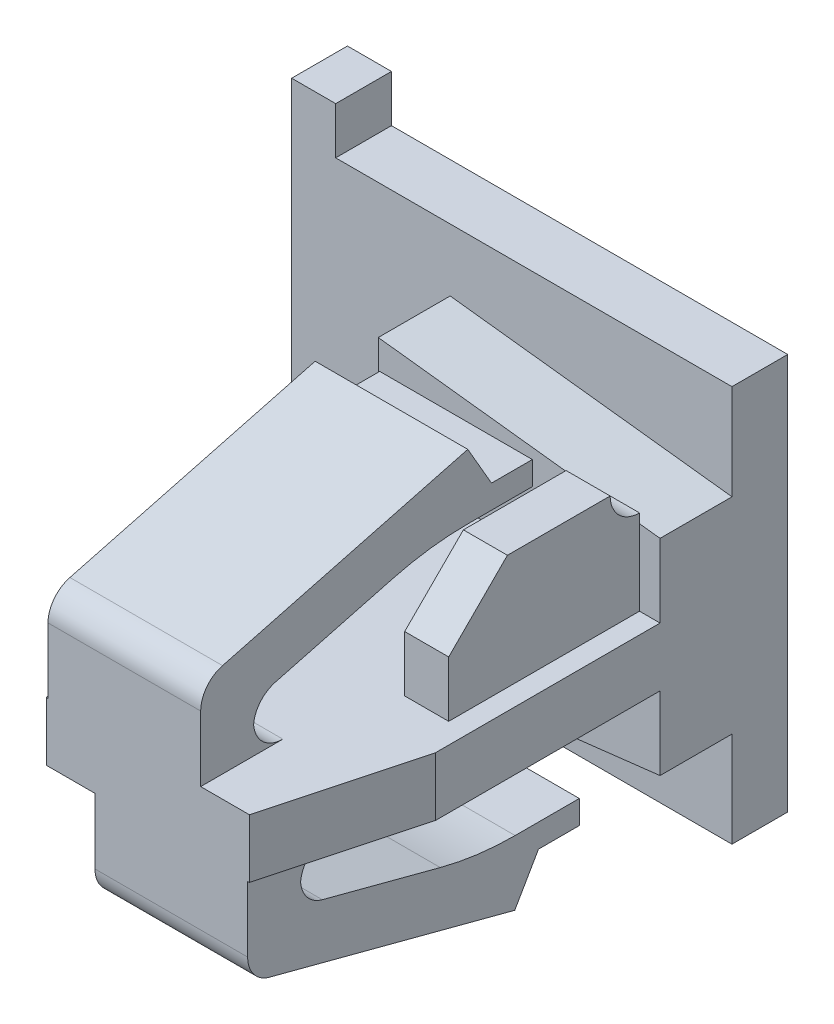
ISO-10303-21;
HEADER;
FILE_DESCRIPTION(('STEP AP214'),'2;1');
FILE_NAME('part.step','',(''),(''),'','','');
FILE_SCHEMA(('AUTOMOTIVE_DESIGN { 1 0 10303 214 1 1 1 1 }'));
ENDSEC;
DATA;
#1=APPLICATION_CONTEXT('core data for automotive mechanical design processes');
#2=APPLICATION_PROTOCOL_DEFINITION('international standard','automotive_design',2000,#1);
#3=PRODUCT_CONTEXT('',#1,'mechanical');
#4=PRODUCT('Part','Part','',(#3));
#5=PRODUCT_RELATED_PRODUCT_CATEGORY('part','',(#4));
#6=PRODUCT_DEFINITION_FORMATION('','',#4);
#7=PRODUCT_DEFINITION_CONTEXT('part definition',#1,'design');
#8=PRODUCT_DEFINITION('design','',#6,#7);
#9=PRODUCT_DEFINITION_SHAPE('','',#8);
#10=(LENGTH_UNIT() NAMED_UNIT(*) SI_UNIT(.MILLI.,.METRE.));
#11=(NAMED_UNIT(*) PLANE_ANGLE_UNIT() SI_UNIT($,.RADIAN.));
#12=(NAMED_UNIT(*) SI_UNIT($,.STERADIAN.) SOLID_ANGLE_UNIT());
#13=UNCERTAINTY_MEASURE_WITH_UNIT(LENGTH_MEASURE(1.E-05),#10,'distance_accuracy_value','');
#14=(GEOMETRIC_REPRESENTATION_CONTEXT(3) GLOBAL_UNCERTAINTY_ASSIGNED_CONTEXT((#13)) GLOBAL_UNIT_ASSIGNED_CONTEXT((#10,
#11,#12)) REPRESENTATION_CONTEXT('',''));
#15=CARTESIAN_POINT('',(0.,0.,0.));
#16=DIRECTION('',(0.,0.,1.));
#17=DIRECTION('',(1.,0.,0.));
#18=AXIS2_PLACEMENT_3D('',#15,#16,#17);
#19=CARTESIAN_POINT('',(0.,0.,17.));
#20=DIRECTION('',(0.,1.,0.));
#21=DIRECTION('',(0.,0.,1.));
#22=AXIS2_PLACEMENT_3D('',#19,#20,#21);
#23=PLANE('',#22);
#24=DIRECTION('',(0.,0.,1.));
#25=VECTOR('',#24,1.);
#26=CARTESIAN_POINT('',(1.5,0.,-2.19317121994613));
#27=LINE('',#26,#25);
#28=CARTESIAN_POINT('',(1.5,0.,0.));
#29=VERTEX_POINT('',#28);
#30=CARTESIAN_POINT('',(1.5,0.,1.9));
#31=VERTEX_POINT('',#30);
#32=EDGE_CURVE('E428',#29,#31,#27,.T.);
#33=ORIENTED_EDGE('',*,*,#32,.F.);
#34=DIRECTION('',(1.,0.,0.));
#35=VECTOR('',#34,1.);
#36=CARTESIAN_POINT('',(0.,0.,0.));
#37=LINE('',#36,#35);
#38=CARTESIAN_POINT('',(15.,0.,0.));
#39=VERTEX_POINT('',#38);
#40=EDGE_CURVE('E398',#29,#39,#37,.T.);
#41=ORIENTED_EDGE('',*,*,#40,.T.);
#42=DIRECTION('',(0.,0.,-1.));
#43=VECTOR('',#42,1.);
#44=CARTESIAN_POINT('',(15.,0.,17.));
#45=LINE('',#44,#43);
#46=CARTESIAN_POINT('',(15.,0.,1.9));
#47=VERTEX_POINT('',#46);
#48=EDGE_CURVE('E658',#47,#39,#45,.T.);
#49=ORIENTED_EDGE('',*,*,#48,.F.);
#50=DIRECTION('',(1.,0.,0.));
#51=VECTOR('',#50,1.);
#52=CARTESIAN_POINT('',(0.,0.,1.9));
#53=LINE('',#52,#51);
#54=EDGE_CURVE('E647',#31,#47,#53,.T.);
#55=ORIENTED_EDGE('',*,*,#54,.F.);
#56=EDGE_LOOP('',(#33,#41,#49,#55));
#57=FACE_BOUND('',#56,.T.);
#58=ADVANCED_FACE('F39',(#57),#23,.F.);
#59=CARTESIAN_POINT('',(0.,7.75,4.35));
#60=DIRECTION('',(0.,0.,-1.));
#61=DIRECTION('',(-1.,0.,0.));
#62=AXIS2_PLACEMENT_3D('',#59,#60,#61);
#63=PLANE('',#62);
#64=DIRECTION('',(0.,1.,0.));
#65=VECTOR('',#64,1.);
#66=CARTESIAN_POINT('',(14.3,7.75,4.35));
#67=LINE('',#66,#65);
#68=CARTESIAN_POINT('',(14.3,7.75,4.35));
#69=VERTEX_POINT('',#68);
#70=CARTESIAN_POINT('',(14.3,10.33203125,4.35));
#71=VERTEX_POINT('',#70);
#72=EDGE_CURVE('E473',#69,#71,#67,.T.);
#73=ORIENTED_EDGE('',*,*,#72,.F.);
#74=DIRECTION('',(1.,0.,0.));
#75=VECTOR('',#74,1.);
#76=CARTESIAN_POINT('',(0.,7.75,4.35));
#77=LINE('',#76,#75);
#78=CARTESIAN_POINT('',(15.,7.75,4.35));
#79=VERTEX_POINT('',#78);
#80=EDGE_CURVE('E629',#69,#79,#77,.T.);
#81=ORIENTED_EDGE('',*,*,#80,.T.);
#82=DIRECTION('',(0.,1.,0.));
#83=VECTOR('',#82,1.);
#84=CARTESIAN_POINT('',(15.,7.75,4.35));
#85=LINE('',#84,#83);
#86=CARTESIAN_POINT('',(15.,10.25,4.35));
#87=VERTEX_POINT('',#86);
#88=EDGE_CURVE('E625',#79,#87,#85,.T.);
#89=ORIENTED_EDGE('',*,*,#88,.T.);
#90=DIRECTION('',(0.993203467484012,-0.116391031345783,0.));
#91=VECTOR('',#90,1.);
#92=CARTESIAN_POINT('',(15.,10.25,4.35));
#93=LINE('',#92,#91);
#94=EDGE_CURVE('E515',#71,#87,#93,.T.);
#95=ORIENTED_EDGE('',*,*,#94,.F.);
#96=EDGE_LOOP('',(#73,#81,#89,#95));
#97=FACE_BOUND('',#96,.T.);
#98=ADVANCED_FACE('F808',(#97),#63,.F.);
#99=DIRECTION('',(0.,-1.,0.));
#100=VECTOR('',#99,1.);
#101=CARTESIAN_POINT('',(12.8,7.75,4.35));
#102=LINE('',#101,#100);
#103=CARTESIAN_POINT('',(12.8,10.5078125,4.35));
#104=VERTEX_POINT('',#103);
#105=CARTESIAN_POINT('',(12.8,7.75,4.35));
#106=VERTEX_POINT('',#105);
#107=EDGE_CURVE('E475',#104,#106,#102,.T.);
#108=ORIENTED_EDGE('',*,*,#107,.F.);
#109=CARTESIAN_POINT('',(5.4,11.375,4.35));
#110=VERTEX_POINT('',#109);
#111=EDGE_CURVE('E511',#110,#104,#93,.T.);
#112=ORIENTED_EDGE('',*,*,#111,.F.);
#113=DIRECTION('',(0.,-1.,0.));
#114=VECTOR('',#113,1.);
#115=CARTESIAN_POINT('',(5.4,0.499999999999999,4.35));
#116=LINE('',#115,#114);
#117=CARTESIAN_POINT('',(5.4,7.75,4.35));
#118=VERTEX_POINT('',#117);
#119=EDGE_CURVE('E675',#110,#118,#116,.T.);
#120=ORIENTED_EDGE('',*,*,#119,.T.);
#121=EDGE_CURVE('E630',#118,#106,#77,.T.);
#122=ORIENTED_EDGE('',*,*,#121,.T.);
#123=EDGE_LOOP('',(#108,#112,#120,#122));
#124=FACE_BOUND('',#123,.T.);
#125=ADVANCED_FACE('F846',(#124),#63,.F.);
#126=CARTESIAN_POINT('',(0.,7.75,17.));
#127=DIRECTION('',(0.,-1.,0.));
#128=DIRECTION('',(0.,0.,-1.));
#129=AXIS2_PLACEMENT_3D('',#126,#127,#128);
#130=PLANE('',#129);
#131=DIRECTION('',(1.,0.,0.));
#132=VECTOR('',#131,1.);
#133=CARTESIAN_POINT('',(15.,7.75,17.));
#134=LINE('',#133,#132);
#135=CARTESIAN_POINT('',(12.,7.75,17.));
#136=VERTEX_POINT('',#135);
#137=CARTESIAN_POINT('',(13.6602540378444,7.75,17.));
#138=VERTEX_POINT('',#137);
#139=EDGE_CURVE('E547',#136,#138,#134,.T.);
#140=ORIENTED_EDGE('',*,*,#139,.T.);
#141=DIRECTION('',(-0.258819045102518,0.,0.965925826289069));
#142=VECTOR('',#141,1.);
#143=CARTESIAN_POINT('',(13.6602540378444,7.75,17.));
#144=LINE('',#143,#142);
#145=CARTESIAN_POINT('',(15.,7.75,11.9999999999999));
#146=VERTEX_POINT('',#145);
#147=EDGE_CURVE('E785',#138,#146,#144,.F.);
#148=ORIENTED_EDGE('',*,*,#147,.T.);
#149=DIRECTION('',(0.,0.,-1.));
#150=VECTOR('',#149,1.);
#151=CARTESIAN_POINT('',(15.,7.75,17.));
#152=LINE('',#151,#150);
#153=EDGE_CURVE('E623',#146,#79,#152,.T.);
#154=ORIENTED_EDGE('',*,*,#153,.T.);
#155=ORIENTED_EDGE('',*,*,#80,.F.);
#156=DIRECTION('',(0.,0.,-1.));
#157=VECTOR('',#156,1.);
#158=CARTESIAN_POINT('',(14.3,7.75,10.85));
#159=LINE('',#158,#157);
#160=CARTESIAN_POINT('',(14.3,7.75,10.85));
#161=VERTEX_POINT('',#160);
#162=EDGE_CURVE('E472',#161,#69,#159,.T.);
#163=ORIENTED_EDGE('',*,*,#162,.F.);
#164=DIRECTION('',(1.,0.,0.));
#165=VECTOR('',#164,1.);
#166=CARTESIAN_POINT('',(14.3,7.75,10.85));
#167=LINE('',#166,#165);
#168=CARTESIAN_POINT('',(12.8,7.75,10.85));
#169=VERTEX_POINT('',#168);
#170=EDGE_CURVE('E470',#169,#161,#167,.T.);
#171=ORIENTED_EDGE('',*,*,#170,.F.);
#172=DIRECTION('',(0.,0.,-1.));
#173=VECTOR('',#172,1.);
#174=CARTESIAN_POINT('',(12.8,7.75,10.85));
#175=LINE('',#174,#173);
#176=EDGE_CURVE('E478',#169,#106,#175,.T.);
#177=ORIENTED_EDGE('',*,*,#176,.T.);
#178=ORIENTED_EDGE('',*,*,#121,.F.);
#179=DIRECTION('',(0.,0.,1.));
#180=VECTOR('',#179,1.);
#181=CARTESIAN_POINT('',(5.4,7.75,1.9));
#182=LINE('',#181,#180);
#183=CARTESIAN_POINT('',(5.4,7.75,11.9999999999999));
#184=VERTEX_POINT('',#183);
#185=EDGE_CURVE('E672',#118,#184,#182,.T.);
#186=ORIENTED_EDGE('',*,*,#185,.T.);
#187=DIRECTION('',(0.258819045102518,0.,0.965925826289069));
#188=VECTOR('',#187,1.);
#189=CARTESIAN_POINT('',(6.73974596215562,7.75,17.));
#190=LINE('',#189,#188);
#191=CARTESIAN_POINT('',(6.73974596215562,7.75,17.));
#192=VERTEX_POINT('',#191);
#193=EDGE_CURVE('E783',#184,#192,#190,.T.);
#194=ORIENTED_EDGE('',*,*,#193,.T.);
#195=DIRECTION('',(1.,0.,0.));
#196=VECTOR('',#195,1.);
#197=CARTESIAN_POINT('',(5.4,7.75,17.));
#198=LINE('',#197,#196);
#199=CARTESIAN_POINT('',(6.8,7.75,17.));
#200=VERTEX_POINT('',#199);
#201=EDGE_CURVE('E535',#192,#200,#198,.T.);
#202=ORIENTED_EDGE('',*,*,#201,.T.);
#203=DIRECTION('',(0.,0.,1.));
#204=VECTOR('',#203,1.);
#205=CARTESIAN_POINT('',(6.8,7.75,-1.8273780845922));
#206=LINE('',#205,#204);
#207=CARTESIAN_POINT('',(6.8,7.75,14.2));
#208=VERTEX_POINT('',#207);
#209=EDGE_CURVE('E534',#208,#200,#206,.T.);
#210=ORIENTED_EDGE('',*,*,#209,.F.);
#211=DIRECTION('',(1.,0.,0.));
#212=VECTOR('',#211,1.);
#213=CARTESIAN_POINT('',(0.,7.75,14.2));
#214=LINE('',#213,#212);
#215=CARTESIAN_POINT('',(12.,7.75,14.2));
#216=VERTEX_POINT('',#215);
#217=EDGE_CURVE('E695',#208,#216,#214,.T.);
#218=ORIENTED_EDGE('',*,*,#217,.T.);
#219=DIRECTION('',(0.,0.,1.));
#220=VECTOR('',#219,1.);
#221=CARTESIAN_POINT('',(12.,7.75,-1.8273780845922));
#222=LINE('',#221,#220);
#223=EDGE_CURVE('E550',#216,#136,#222,.T.);
#224=ORIENTED_EDGE('',*,*,#223,.T.);
#225=EDGE_LOOP('',(#140,#148,#154,#155,#163,#171,#177,#178,#186,#194,#202,#210,#218,#224));
#226=FACE_BOUND('',#225,.T.);
#227=ADVANCED_FACE('F799',(#226),#130,.F.);
#228=CARTESIAN_POINT('',(0.,5.75,17.));
#229=DIRECTION('',(0.,1.,0.));
#230=DIRECTION('',(0.,0.,1.));
#231=AXIS2_PLACEMENT_3D('',#228,#229,#230);
#232=PLANE('',#231);
#233=DIRECTION('',(0.,0.,1.));
#234=VECTOR('',#233,1.);
#235=CARTESIAN_POINT('',(15.,5.75,17.));
#236=LINE('',#235,#234);
#237=CARTESIAN_POINT('',(15.,5.75,4.35));
#238=VERTEX_POINT('',#237);
#239=CARTESIAN_POINT('',(15.,5.75,11.9999999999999));
#240=VERTEX_POINT('',#239);
#241=EDGE_CURVE('E636',#238,#240,#236,.T.);
#242=ORIENTED_EDGE('',*,*,#241,.T.);
#243=DIRECTION('',(0.258819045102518,0.,-0.965925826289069));
#244=VECTOR('',#243,1.);
#245=CARTESIAN_POINT('',(13.6602540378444,5.75,17.));
#246=LINE('',#245,#244);
#247=CARTESIAN_POINT('',(13.6602540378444,5.75,17.));
#248=VERTEX_POINT('',#247);
#249=EDGE_CURVE('E48',#240,#248,#246,.F.);
#250=ORIENTED_EDGE('',*,*,#249,.T.);
#251=DIRECTION('',(-1.,0.,0.));
#252=VECTOR('',#251,1.);
#253=CARTESIAN_POINT('',(15.,5.75,17.));
#254=LINE('',#253,#252);
#255=CARTESIAN_POINT('',(13.6,5.75,17.));
#256=VERTEX_POINT('',#255);
#257=EDGE_CURVE('E530',#248,#256,#254,.T.);
#258=ORIENTED_EDGE('',*,*,#257,.T.);
#259=DIRECTION('',(0.,0.,1.));
#260=VECTOR('',#259,1.);
#261=CARTESIAN_POINT('',(13.6,5.75,-1.8273780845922));
#262=LINE('',#261,#260);
#263=CARTESIAN_POINT('',(13.6,5.75,14.2));
#264=VERTEX_POINT('',#263);
#265=EDGE_CURVE('E537',#264,#256,#262,.T.);
#266=ORIENTED_EDGE('',*,*,#265,.F.);
#267=DIRECTION('',(1.,0.,0.));
#268=VECTOR('',#267,1.);
#269=CARTESIAN_POINT('',(0.,5.75,14.2));
#270=LINE('',#269,#268);
#271=CARTESIAN_POINT('',(8.4,5.75,14.2));
#272=VERTEX_POINT('',#271);
#273=EDGE_CURVE('E692',#264,#272,#270,.F.);
#274=ORIENTED_EDGE('',*,*,#273,.T.);
#275=DIRECTION('',(0.,0.,1.));
#276=VECTOR('',#275,1.);
#277=CARTESIAN_POINT('',(8.4,5.75,-1.8273780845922));
#278=LINE('',#277,#276);
#279=CARTESIAN_POINT('',(8.4,5.75,17.));
#280=VERTEX_POINT('',#279);
#281=EDGE_CURVE('E526',#272,#280,#278,.T.);
#282=ORIENTED_EDGE('',*,*,#281,.T.);
#283=DIRECTION('',(-1.,0.,0.));
#284=VECTOR('',#283,1.);
#285=CARTESIAN_POINT('',(5.4,5.75,17.));
#286=LINE('',#285,#284);
#287=CARTESIAN_POINT('',(6.73974596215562,5.75,17.));
#288=VERTEX_POINT('',#287);
#289=EDGE_CURVE('E524',#280,#288,#286,.T.);
#290=ORIENTED_EDGE('',*,*,#289,.T.);
#291=DIRECTION('',(-0.258819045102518,0.,-0.965925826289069));
#292=VECTOR('',#291,1.);
#293=CARTESIAN_POINT('',(6.73974596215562,5.75,17.));
#294=LINE('',#293,#292);
#295=CARTESIAN_POINT('',(5.4,5.75,11.9999999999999));
#296=VERTEX_POINT('',#295);
#297=EDGE_CURVE('E55',#288,#296,#294,.T.);
#298=ORIENTED_EDGE('',*,*,#297,.T.);
#299=DIRECTION('',(0.,0.,-1.));
#300=VECTOR('',#299,1.);
#301=CARTESIAN_POINT('',(5.4,5.75,1.9));
#302=LINE('',#301,#300);
#303=CARTESIAN_POINT('',(5.4,5.75,4.35));
#304=VERTEX_POINT('',#303);
#305=EDGE_CURVE('E670',#296,#304,#302,.T.);
#306=ORIENTED_EDGE('',*,*,#305,.T.);
#307=DIRECTION('',(1.,0.,0.));
#308=VECTOR('',#307,1.);
#309=CARTESIAN_POINT('',(0.,5.75,4.35));
#310=LINE('',#309,#308);
#311=CARTESIAN_POINT('',(6.1,5.75,4.35));
#312=VERTEX_POINT('',#311);
#313=EDGE_CURVE('E626',#304,#312,#310,.T.);
#314=ORIENTED_EDGE('',*,*,#313,.T.);
#315=DIRECTION('',(0.,0.,-1.));
#316=VECTOR('',#315,1.);
#317=CARTESIAN_POINT('',(6.1,5.75,10.85));
#318=LINE('',#317,#316);
#319=CARTESIAN_POINT('',(6.1,5.75,10.85));
#320=VERTEX_POINT('',#319);
#321=EDGE_CURVE('E494',#320,#312,#318,.T.);
#322=ORIENTED_EDGE('',*,*,#321,.F.);
#323=DIRECTION('',(-1.,0.,0.));
#324=VECTOR('',#323,1.);
#325=CARTESIAN_POINT('',(6.1,5.75,10.85));
#326=LINE('',#325,#324);
#327=CARTESIAN_POINT('',(7.6,5.75,10.85));
#328=VERTEX_POINT('',#327);
#329=EDGE_CURVE('E492',#328,#320,#326,.T.);
#330=ORIENTED_EDGE('',*,*,#329,.F.);
#331=DIRECTION('',(0.,0.,-1.));
#332=VECTOR('',#331,1.);
#333=CARTESIAN_POINT('',(7.6,5.75,10.85));
#334=LINE('',#333,#332);
#335=CARTESIAN_POINT('',(7.6,5.75,4.35));
#336=VERTEX_POINT('',#335);
#337=EDGE_CURVE('E499',#328,#336,#334,.T.);
#338=ORIENTED_EDGE('',*,*,#337,.T.);
#339=EDGE_CURVE('E638',#336,#238,#310,.T.);
#340=ORIENTED_EDGE('',*,*,#339,.T.);
#341=EDGE_LOOP('',(#242,#250,#258,#266,#274,#282,#290,#298,#306,#314,#322,#330,#338,#340));
#342=FACE_BOUND('',#341,.T.);
#343=ADVANCED_FACE('F790',(#342),#232,.F.);
#344=CARTESIAN_POINT('',(0.,5.75,4.35));
#345=DIRECTION('',(0.,0.,-1.));
#346=DIRECTION('',(-1.,0.,0.));
#347=AXIS2_PLACEMENT_3D('',#344,#345,#346);
#348=PLANE('',#347);
#349=DIRECTION('',(0.,1.,0.));
#350=VECTOR('',#349,1.);
#351=CARTESIAN_POINT('',(7.6,5.75,4.35));
#352=LINE('',#351,#350);
#353=CARTESIAN_POINT('',(7.6,2.85,4.35));
#354=VERTEX_POINT('',#353);
#355=EDGE_CURVE('E490',#354,#336,#352,.T.);
#356=ORIENTED_EDGE('',*,*,#355,.F.);
#357=DIRECTION('',(-1.,0.,0.));
#358=VECTOR('',#357,1.);
#359=CARTESIAN_POINT('',(9.0142135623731,2.85,4.35));
#360=LINE('',#359,#358);
#361=CARTESIAN_POINT('',(6.1,2.85,4.35));
#362=VERTEX_POINT('',#361);
#363=EDGE_CURVE('E444',#354,#362,#360,.T.);
#364=ORIENTED_EDGE('',*,*,#363,.T.);
#365=DIRECTION('',(0.,-1.,0.));
#366=VECTOR('',#365,1.);
#367=CARTESIAN_POINT('',(6.1,5.75,4.35));
#368=LINE('',#367,#366);
#369=EDGE_CURVE('E485',#312,#362,#368,.T.);
#370=ORIENTED_EDGE('',*,*,#369,.F.);
#371=ORIENTED_EDGE('',*,*,#313,.F.);
#372=DIRECTION('',(0.,-1.,0.));
#373=VECTOR('',#372,1.);
#374=CARTESIAN_POINT('',(5.4,0.499999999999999,4.35));
#375=LINE('',#374,#373);
#376=CARTESIAN_POINT('',(5.4,2.125,4.35));
#377=VERTEX_POINT('',#376);
#378=EDGE_CURVE('E667',#304,#377,#375,.T.);
#379=ORIENTED_EDGE('',*,*,#378,.T.);
#380=DIRECTION('',(-0.993203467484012,-0.116391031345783,0.));
#381=VECTOR('',#380,1.);
#382=CARTESIAN_POINT('',(15.,3.25,4.35));
#383=LINE('',#382,#381);
#384=CARTESIAN_POINT('',(15.,3.25,4.35));
#385=VERTEX_POINT('',#384);
#386=EDGE_CURVE('E506',#385,#377,#383,.T.);
#387=ORIENTED_EDGE('',*,*,#386,.F.);
#388=DIRECTION('',(0.,1.,0.));
#389=VECTOR('',#388,1.);
#390=CARTESIAN_POINT('',(15.,5.75,4.35));
#391=LINE('',#390,#389);
#392=EDGE_CURVE('E614',#385,#238,#391,.T.);
#393=ORIENTED_EDGE('',*,*,#392,.T.);
#394=ORIENTED_EDGE('',*,*,#339,.F.);
#395=EDGE_LOOP('',(#356,#364,#370,#371,#379,#387,#393,#394));
#396=FACE_BOUND('',#395,.T.);
#397=ADVANCED_FACE('F936',(#396),#348,.F.);
#398=CARTESIAN_POINT('',(0.,0.,17.));
#399=DIRECTION('',(1.,0.,0.));
#400=DIRECTION('',(0.,0.,-1.));
#401=AXIS2_PLACEMENT_3D('',#398,#399,#400);
#402=PLANE('',#401);
#403=DIRECTION('',(0.,-1.,0.));
#404=VECTOR('',#403,1.);
#405=CARTESIAN_POINT('',(0.,0.,1.9));
#406=LINE('',#405,#404);
#407=CARTESIAN_POINT('',(0.,15.1,1.9));
#408=VERTEX_POINT('',#407);
#409=CARTESIAN_POINT('',(0.,-1.6,1.9));
#410=VERTEX_POINT('',#409);
#411=EDGE_CURVE('E645',#408,#410,#406,.T.);
#412=ORIENTED_EDGE('',*,*,#411,.F.);
#413=DIRECTION('',(0.,0.,1.));
#414=VECTOR('',#413,1.);
#415=CARTESIAN_POINT('',(0.,15.1,-2.19317121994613));
#416=LINE('',#415,#414);
#417=CARTESIAN_POINT('',(0.,15.1,0.));
#418=VERTEX_POINT('',#417);
#419=EDGE_CURVE('E395',#418,#408,#416,.T.);
#420=ORIENTED_EDGE('',*,*,#419,.F.);
#421=DIRECTION('',(0.,-1.,0.));
#422=VECTOR('',#421,1.);
#423=CARTESIAN_POINT('',(0.,0.,0.));
#424=LINE('',#423,#422);
#425=CARTESIAN_POINT('',(0.,-1.6,0.));
#426=VERTEX_POINT('',#425);
#427=EDGE_CURVE('E388',#418,#426,#424,.T.);
#428=ORIENTED_EDGE('',*,*,#427,.T.);
#429=DIRECTION('',(0.,0.,1.));
#430=VECTOR('',#429,1.);
#431=CARTESIAN_POINT('',(0.,-1.6,-2.19317121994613));
#432=LINE('',#431,#430);
#433=EDGE_CURVE('E392',#426,#410,#432,.T.);
#434=ORIENTED_EDGE('',*,*,#433,.T.);
#435=EDGE_LOOP('',(#412,#420,#428,#434));
#436=FACE_BOUND('',#435,.T.);
#437=ADVANCED_FACE('F390',(#436),#402,.F.);
#438=CARTESIAN_POINT('',(15.,0.,17.));
#439=DIRECTION('',(-1.,0.,0.));
#440=DIRECTION('',(0.,0.,1.));
#441=AXIS2_PLACEMENT_3D('',#438,#439,#440);
#442=PLANE('',#441);
#443=ORIENTED_EDGE('',*,*,#153,.F.);
#444=DIRECTION('',(0.,-1.,0.));
#445=VECTOR('',#444,1.);
#446=CARTESIAN_POINT('',(15.,0.,11.9999999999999));
#447=LINE('',#446,#445);
#448=EDGE_CURVE('E63',#146,#240,#447,.T.);
#449=ORIENTED_EDGE('',*,*,#448,.T.);
#450=ORIENTED_EDGE('',*,*,#241,.F.);
#451=ORIENTED_EDGE('',*,*,#392,.F.);
#452=DIRECTION('',(0.,0.,1.));
#453=VECTOR('',#452,1.);
#454=CARTESIAN_POINT('',(15.,3.25,-7.76569319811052));
#455=LINE('',#454,#453);
#456=CARTESIAN_POINT('',(15.,3.25,1.9));
#457=VERTEX_POINT('',#456);
#458=EDGE_CURVE('E519',#457,#385,#455,.T.);
#459=ORIENTED_EDGE('',*,*,#458,.F.);
#460=DIRECTION('',(0.,1.,0.));
#461=VECTOR('',#460,1.);
#462=CARTESIAN_POINT('',(15.,0.,1.9));
#463=LINE('',#462,#461);
#464=EDGE_CURVE('E399',#47,#457,#463,.T.);
#465=ORIENTED_EDGE('',*,*,#464,.F.);
#466=ORIENTED_EDGE('',*,*,#48,.T.);
#467=DIRECTION('',(0.,1.,0.));
#468=VECTOR('',#467,1.);
#469=CARTESIAN_POINT('',(15.,0.,0.));
#470=LINE('',#469,#468);
#471=CARTESIAN_POINT('',(15.,13.5,0.));
#472=VERTEX_POINT('',#471);
#473=EDGE_CURVE('E650',#39,#472,#470,.T.);
#474=ORIENTED_EDGE('',*,*,#473,.T.);
#475=DIRECTION('',(0.,0.,-1.));
#476=VECTOR('',#475,1.);
#477=CARTESIAN_POINT('',(15.,13.5,17.));
#478=LINE('',#477,#476);
#479=CARTESIAN_POINT('',(15.,13.5,1.9));
#480=VERTEX_POINT('',#479);
#481=EDGE_CURVE('E656',#480,#472,#478,.T.);
#482=ORIENTED_EDGE('',*,*,#481,.F.);
#483=CARTESIAN_POINT('',(15.,10.25,1.9));
#484=VERTEX_POINT('',#483);
#485=EDGE_CURVE('E643',#484,#480,#463,.T.);
#486=ORIENTED_EDGE('',*,*,#485,.F.);
#487=DIRECTION('',(0.,0.,1.));
#488=VECTOR('',#487,1.);
#489=CARTESIAN_POINT('',(15.,10.25,-7.76569319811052));
#490=LINE('',#489,#488);
#491=EDGE_CURVE('E510',#484,#87,#490,.T.);
#492=ORIENTED_EDGE('',*,*,#491,.T.);
#493=ORIENTED_EDGE('',*,*,#88,.F.);
#494=EDGE_LOOP('',(#443,#449,#450,#451,#459,#465,#466,#474,#482,#486,#492,#493));
#495=FACE_BOUND('',#494,.T.);
#496=ADVANCED_FACE('F803',(#495),#442,.F.);
#497=CARTESIAN_POINT('',(0.,13.5,17.));
#498=DIRECTION('',(0.,-1.,0.));
#499=DIRECTION('',(0.,0.,-1.));
#500=AXIS2_PLACEMENT_3D('',#497,#498,#499);
#501=PLANE('',#500);
#502=DIRECTION('',(-1.,0.,0.));
#503=VECTOR('',#502,1.);
#504=CARTESIAN_POINT('',(0.,13.5,0.));
#505=LINE('',#504,#503);
#506=CARTESIAN_POINT('',(1.5,13.5,0.));
#507=VERTEX_POINT('',#506);
#508=EDGE_CURVE('E653',#472,#507,#505,.T.);
#509=ORIENTED_EDGE('',*,*,#508,.T.);
#510=DIRECTION('',(0.,0.,1.));
#511=VECTOR('',#510,1.);
#512=CARTESIAN_POINT('',(1.5,13.5,-2.19317121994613));
#513=LINE('',#512,#511);
#514=CARTESIAN_POINT('',(1.5,13.5,1.9));
#515=VERTEX_POINT('',#514);
#516=EDGE_CURVE('E424',#507,#515,#513,.T.);
#517=ORIENTED_EDGE('',*,*,#516,.T.);
#518=DIRECTION('',(-1.,0.,0.));
#519=VECTOR('',#518,1.);
#520=CARTESIAN_POINT('',(0.,13.5,1.9));
#521=LINE('',#520,#519);
#522=EDGE_CURVE('E661',#480,#515,#521,.T.);
#523=ORIENTED_EDGE('',*,*,#522,.F.);
#524=ORIENTED_EDGE('',*,*,#481,.T.);
#525=EDGE_LOOP('',(#509,#517,#523,#524));
#526=FACE_BOUND('',#525,.T.);
#527=ADVANCED_FACE('F941',(#526),#501,.F.);
#528=CARTESIAN_POINT('',(0.,0.,17.));
#529=DIRECTION('',(0.,0.,-1.));
#530=DIRECTION('',(-1.,0.,0.));
#531=AXIS2_PLACEMENT_3D('',#528,#529,#530);
#532=PLANE('',#531);
#533=ORIENTED_EDGE('',*,*,#257,.F.);
#534=DIRECTION('',(0.,1.,0.));
#535=VECTOR('',#534,1.);
#536=CARTESIAN_POINT('',(13.6602540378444,0.,17.));
#537=LINE('',#536,#535);
#538=EDGE_CURVE('E780',#248,#138,#537,.T.);
#539=ORIENTED_EDGE('',*,*,#538,.T.);
#540=ORIENTED_EDGE('',*,*,#139,.F.);
#541=DIRECTION('',(0.,-1.,0.));
#542=VECTOR('',#541,1.);
#543=CARTESIAN_POINT('',(12.,7.75,17.));
#544=LINE('',#543,#542);
#545=CARTESIAN_POINT('',(12.,9.97954246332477,17.));
#546=VERTEX_POINT('',#545);
#547=EDGE_CURVE('E540',#546,#136,#544,.T.);
#548=ORIENTED_EDGE('',*,*,#547,.F.);
#549=DIRECTION('',(1.,0.,0.));
#550=VECTOR('',#549,1.);
#551=CARTESIAN_POINT('',(6.8,9.97954246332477,17.));
#552=LINE('',#551,#550);
#553=CARTESIAN_POINT('',(6.8,9.97954246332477,17.));
#554=VERTEX_POINT('',#553);
#555=EDGE_CURVE('E709',#546,#554,#552,.F.);
#556=ORIENTED_EDGE('',*,*,#555,.T.);
#557=DIRECTION('',(0.,1.,0.));
#558=VECTOR('',#557,1.);
#559=CARTESIAN_POINT('',(6.8,7.75,17.));
#560=LINE('',#559,#558);
#561=EDGE_CURVE('E531',#200,#554,#560,.T.);
#562=ORIENTED_EDGE('',*,*,#561,.F.);
#563=ORIENTED_EDGE('',*,*,#201,.F.);
#564=DIRECTION('',(0.,-1.,0.));
#565=VECTOR('',#564,1.);
#566=CARTESIAN_POINT('',(6.73974596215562,5.75,17.));
#567=LINE('',#566,#565);
#568=EDGE_CURVE('E777',#192,#288,#567,.T.);
#569=ORIENTED_EDGE('',*,*,#568,.T.);
#570=ORIENTED_EDGE('',*,*,#289,.F.);
#571=DIRECTION('',(0.,1.,0.));
#572=VECTOR('',#571,1.);
#573=CARTESIAN_POINT('',(8.4,5.75,17.));
#574=LINE('',#573,#572);
#575=CARTESIAN_POINT('',(8.4,3.52045753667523,17.));
#576=VERTEX_POINT('',#575);
#577=EDGE_CURVE('E509',#576,#280,#574,.T.);
#578=ORIENTED_EDGE('',*,*,#577,.F.);
#579=DIRECTION('',(1.,0.,0.));
#580=VECTOR('',#579,1.);
#581=CARTESIAN_POINT('',(13.6,3.52045753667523,17.));
#582=LINE('',#581,#580);
#583=CARTESIAN_POINT('',(13.6,3.52045753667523,17.));
#584=VERTEX_POINT('',#583);
#585=EDGE_CURVE('E706',#576,#584,#582,.T.);
#586=ORIENTED_EDGE('',*,*,#585,.T.);
#587=DIRECTION('',(0.,-1.,0.));
#588=VECTOR('',#587,1.);
#589=CARTESIAN_POINT('',(13.6,5.75,17.));
#590=LINE('',#589,#588);
#591=EDGE_CURVE('E541',#256,#584,#590,.T.);
#592=ORIENTED_EDGE('',*,*,#591,.F.);
#593=EDGE_LOOP('',(#533,#539,#540,#548,#556,#562,#563,#569,#570,#578,#586,#592));
#594=FACE_BOUND('',#593,.T.);
#595=ADVANCED_FACE('F795',(#594),#532,.F.);
#596=CARTESIAN_POINT('',(0.,0.,0.));
#597=DIRECTION('',(0.,0.,-1.));
#598=DIRECTION('',(-1.,0.,0.));
#599=AXIS2_PLACEMENT_3D('',#596,#597,#598);
#600=PLANE('',#599);
#601=ORIENTED_EDGE('',*,*,#427,.F.);
#602=DIRECTION('',(-1.,0.,0.));
#603=VECTOR('',#602,1.);
#604=CARTESIAN_POINT('',(0.,15.1,0.));
#605=LINE('',#604,#603);
#606=CARTESIAN_POINT('',(1.5,15.1,0.));
#607=VERTEX_POINT('',#606);
#608=EDGE_CURVE('E429',#607,#418,#605,.T.);
#609=ORIENTED_EDGE('',*,*,#608,.F.);
#610=DIRECTION('',(0.,1.,0.));
#611=VECTOR('',#610,1.);
#612=CARTESIAN_POINT('',(1.5,13.5,0.));
#613=LINE('',#612,#611);
#614=EDGE_CURVE('E432',#507,#607,#613,.T.);
#615=ORIENTED_EDGE('',*,*,#614,.F.);
#616=ORIENTED_EDGE('',*,*,#508,.F.);
#617=ORIENTED_EDGE('',*,*,#473,.F.);
#618=ORIENTED_EDGE('',*,*,#40,.F.);
#619=DIRECTION('',(0.,1.,0.));
#620=VECTOR('',#619,1.);
#621=CARTESIAN_POINT('',(1.5,0.,0.));
#622=LINE('',#621,#620);
#623=CARTESIAN_POINT('',(1.5,-1.6,0.));
#624=VERTEX_POINT('',#623);
#625=EDGE_CURVE('E406',#624,#29,#622,.T.);
#626=ORIENTED_EDGE('',*,*,#625,.F.);
#627=DIRECTION('',(1.,0.,0.));
#628=VECTOR('',#627,1.);
#629=CARTESIAN_POINT('',(0.,-1.6,0.));
#630=LINE('',#629,#628);
#631=EDGE_CURVE('E402',#426,#624,#630,.T.);
#632=ORIENTED_EDGE('',*,*,#631,.F.);
#633=EDGE_LOOP('',(#601,#609,#615,#616,#617,#618,#626,#632));
#634=FACE_BOUND('',#633,.T.);
#635=ADVANCED_FACE('F403',(#634),#600,.T.);
#636=CARTESIAN_POINT('',(7.5,6.75,1.9));
#637=DIRECTION('',(0.,0.,1.));
#638=DIRECTION('',(1.,0.,0.));
#639=AXIS2_PLACEMENT_3D('',#636,#637,#638);
#640=PLANE('',#639);
#641=ORIENTED_EDGE('',*,*,#411,.T.);
#642=DIRECTION('',(1.,0.,0.));
#643=VECTOR('',#642,1.);
#644=CARTESIAN_POINT('',(0.,-1.6,1.9));
#645=LINE('',#644,#643);
#646=CARTESIAN_POINT('',(1.5,-1.6,1.9));
#647=VERTEX_POINT('',#646);
#648=EDGE_CURVE('E413',#410,#647,#645,.T.);
#649=ORIENTED_EDGE('',*,*,#648,.T.);
#650=DIRECTION('',(0.,1.,0.));
#651=VECTOR('',#650,1.);
#652=CARTESIAN_POINT('',(1.5,0.,1.9));
#653=LINE('',#652,#651);
#654=EDGE_CURVE('E414',#647,#31,#653,.T.);
#655=ORIENTED_EDGE('',*,*,#654,.T.);
#656=ORIENTED_EDGE('',*,*,#54,.T.);
#657=ORIENTED_EDGE('',*,*,#464,.T.);
#658=DIRECTION('',(0.993203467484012,0.116391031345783,0.));
#659=VECTOR('',#658,1.);
#660=CARTESIAN_POINT('',(15.,3.25,1.9));
#661=LINE('',#660,#659);
#662=CARTESIAN_POINT('',(5.4,2.125,1.9));
#663=VERTEX_POINT('',#662);
#664=EDGE_CURVE('E521',#663,#457,#661,.T.);
#665=ORIENTED_EDGE('',*,*,#664,.F.);
#666=DIRECTION('',(0.,-1.,0.));
#667=VECTOR('',#666,1.);
#668=CARTESIAN_POINT('',(5.4,0.499999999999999,1.9));
#669=LINE('',#668,#667);
#670=CARTESIAN_POINT('',(5.4,11.375,1.9));
#671=VERTEX_POINT('',#670);
#672=EDGE_CURVE('E633',#671,#663,#669,.T.);
#673=ORIENTED_EDGE('',*,*,#672,.F.);
#674=DIRECTION('',(-0.993203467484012,0.116391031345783,0.));
#675=VECTOR('',#674,1.);
#676=CARTESIAN_POINT('',(15.,10.25,1.9));
#677=LINE('',#676,#675);
#678=EDGE_CURVE('E507',#484,#671,#677,.T.);
#679=ORIENTED_EDGE('',*,*,#678,.F.);
#680=ORIENTED_EDGE('',*,*,#485,.T.);
#681=ORIENTED_EDGE('',*,*,#522,.T.);
#682=DIRECTION('',(0.,1.,0.));
#683=VECTOR('',#682,1.);
#684=CARTESIAN_POINT('',(1.5,13.5,1.9));
#685=LINE('',#684,#683);
#686=CARTESIAN_POINT('',(1.5,15.1,1.9));
#687=VERTEX_POINT('',#686);
#688=EDGE_CURVE('E425',#515,#687,#685,.T.);
#689=ORIENTED_EDGE('',*,*,#688,.T.);
#690=DIRECTION('',(-1.,0.,0.));
#691=VECTOR('',#690,1.);
#692=CARTESIAN_POINT('',(0.,15.1,1.9));
#693=LINE('',#692,#691);
#694=EDGE_CURVE('E421',#687,#408,#693,.T.);
#695=ORIENTED_EDGE('',*,*,#694,.T.);
#696=EDGE_LOOP('',(#641,#649,#655,#656,#657,#665,#673,#679,#680,#681,#689,#695));
#697=FACE_BOUND('',#696,.T.);
#698=ADVANCED_FACE('F954',(#697),#640,.T.);
#699=CARTESIAN_POINT('',(5.4,0.499999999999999,1.9));
#700=DIRECTION('',(-1.,0.,0.));
#701=DIRECTION('',(0.,0.,1.));
#702=AXIS2_PLACEMENT_3D('',#699,#700,#701);
#703=PLANE('',#702);
#704=ORIENTED_EDGE('',*,*,#305,.F.);
#705=DIRECTION('',(0.,1.,0.));
#706=VECTOR('',#705,1.);
#707=CARTESIAN_POINT('',(5.4,7.75,11.9999999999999));
#708=LINE('',#707,#706);
#709=EDGE_CURVE('E12',#296,#184,#708,.T.);
#710=ORIENTED_EDGE('',*,*,#709,.T.);
#711=ORIENTED_EDGE('',*,*,#185,.F.);
#712=ORIENTED_EDGE('',*,*,#119,.F.);
#713=DIRECTION('',(0.,0.,1.));
#714=VECTOR('',#713,1.);
#715=CARTESIAN_POINT('',(5.4,11.375,1.9));
#716=LINE('',#715,#714);
#717=EDGE_CURVE('E677',#671,#110,#716,.T.);
#718=ORIENTED_EDGE('',*,*,#717,.F.);
#719=ORIENTED_EDGE('',*,*,#672,.T.);
#720=DIRECTION('',(0.,0.,-1.));
#721=VECTOR('',#720,1.);
#722=CARTESIAN_POINT('',(5.4,2.125,1.9));
#723=LINE('',#722,#721);
#724=EDGE_CURVE('E664',#377,#663,#723,.T.);
#725=ORIENTED_EDGE('',*,*,#724,.F.);
#726=ORIENTED_EDGE('',*,*,#378,.F.);
#727=EDGE_LOOP('',(#704,#710,#711,#712,#718,#719,#725,#726));
#728=FACE_BOUND('',#727,.T.);
#729=ADVANCED_FACE('F850',(#728),#703,.T.);
#730=CARTESIAN_POINT('',(-7.12397700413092,9.36317643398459,15.2));
#731=DIRECTION('',(0.,-0.966936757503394,-0.255016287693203));
#732=DIRECTION('',(0.,0.255016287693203,-0.966936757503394));
#733=AXIS2_PLACEMENT_3D('',#730,#731,#732);
#734=PLANE('',#733);
#735=DIRECTION('',(0.,-0.255016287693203,0.966936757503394));
#736=VECTOR('',#735,1.);
#737=CARTESIAN_POINT('',(6.8,9.36317643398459,15.2));
#738=LINE('',#737,#736);
#739=CARTESIAN_POINT('',(6.8,10.6193675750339,10.4369419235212));
#740=VERTEX_POINT('',#739);
#741=CARTESIAN_POINT('',(6.8,9.55965565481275,14.4550162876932));
#742=VERTEX_POINT('',#741);
#743=EDGE_CURVE('E596',#740,#742,#738,.T.);
#744=ORIENTED_EDGE('',*,*,#743,.F.);
#745=DIRECTION('',(1.,0.,0.));
#746=VECTOR('',#745,1.);
#747=CARTESIAN_POINT('',(12.,10.6193675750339,10.4369419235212));
#748=LINE('',#747,#746);
#749=CARTESIAN_POINT('',(12.,10.6193675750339,10.4369419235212));
#750=VERTEX_POINT('',#749);
#751=EDGE_CURVE('E746',#740,#750,#748,.T.);
#752=ORIENTED_EDGE('',*,*,#751,.T.);
#753=DIRECTION('',(0.,0.255016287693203,-0.966936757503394));
#754=VECTOR('',#753,1.);
#755=CARTESIAN_POINT('',(12.,9.36317643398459,15.2));
#756=LINE('',#755,#754);
#757=CARTESIAN_POINT('',(12.,9.55965565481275,14.4550162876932));
#758=VERTEX_POINT('',#757);
#759=EDGE_CURVE('E584',#758,#750,#756,.T.);
#760=ORIENTED_EDGE('',*,*,#759,.F.);
#761=DIRECTION('',(1.,0.,0.));
#762=VECTOR('',#761,1.);
#763=CARTESIAN_POINT('',(6.8,9.55965565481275,14.4550162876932));
#764=LINE('',#763,#762);
#765=EDGE_CURVE('E698',#758,#742,#764,.F.);
#766=ORIENTED_EDGE('',*,*,#765,.T.);
#767=EDGE_LOOP('',(#744,#752,#760,#766));
#768=FACE_BOUND('',#767,.T.);
#769=ADVANCED_FACE('F953',(#768),#734,.T.);
#770=CARTESIAN_POINT('',(-7.12397700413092,10.95,9.18329397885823));
#771=DIRECTION('',(0.,-1.,0.));
#772=DIRECTION('',(0.,0.,-1.));
#773=AXIS2_PLACEMENT_3D('',#770,#771,#772);
#774=PLANE('',#773);
#775=DIRECTION('',(0.,0.,-1.));
#776=VECTOR('',#775,1.);
#777=CARTESIAN_POINT('',(12.,10.95,9.18329397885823));
#778=LINE('',#777,#776);
#779=CARTESIAN_POINT('',(12.,10.95,7.88677904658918));
#780=VERTEX_POINT('',#779);
#781=CARTESIAN_POINT('',(12.,10.95,5.7));
#782=VERTEX_POINT('',#781);
#783=EDGE_CURVE('E582',#780,#782,#778,.T.);
#784=ORIENTED_EDGE('',*,*,#783,.F.);
#785=DIRECTION('',(1.,0.,0.));
#786=VECTOR('',#785,1.);
#787=CARTESIAN_POINT('',(6.8,10.95,7.88677904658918));
#788=LINE('',#787,#786);
#789=CARTESIAN_POINT('',(6.8,10.95,7.88677904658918));
#790=VERTEX_POINT('',#789);
#791=EDGE_CURVE('E749',#780,#790,#788,.F.);
#792=ORIENTED_EDGE('',*,*,#791,.T.);
#793=DIRECTION('',(0.,0.,1.));
#794=VECTOR('',#793,1.);
#795=CARTESIAN_POINT('',(6.8,10.95,9.18329397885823));
#796=LINE('',#795,#794);
#797=CARTESIAN_POINT('',(6.8,10.95,5.7));
#798=VERTEX_POINT('',#797);
#799=EDGE_CURVE('E593',#798,#790,#796,.T.);
#800=ORIENTED_EDGE('',*,*,#799,.F.);
#801=DIRECTION('',(1.,0.,0.));
#802=VECTOR('',#801,1.);
#803=CARTESIAN_POINT('',(-7.12397700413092,10.95,5.7));
#804=LINE('',#803,#802);
#805=EDGE_CURVE('E602',#798,#782,#804,.T.);
#806=ORIENTED_EDGE('',*,*,#805,.T.);
#807=EDGE_LOOP('',(#784,#792,#800,#806));
#808=FACE_BOUND('',#807,.T.);
#809=ADVANCED_FACE('F1062',(#808),#774,.T.);
#810=CARTESIAN_POINT('',(-7.12397700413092,11.75,5.7));
#811=DIRECTION('',(0.,0.,-1.));
#812=DIRECTION('',(-1.,0.,0.));
#813=AXIS2_PLACEMENT_3D('',#810,#811,#812);
#814=PLANE('',#813);
#815=DIRECTION('',(0.,-1.,0.));
#816=VECTOR('',#815,1.);
#817=CARTESIAN_POINT('',(6.8,11.75,5.7));
#818=LINE('',#817,#816);
#819=CARTESIAN_POINT('',(6.8,11.75,5.7));
#820=VERTEX_POINT('',#819);
#821=EDGE_CURVE('E591',#820,#798,#818,.T.);
#822=ORIENTED_EDGE('',*,*,#821,.F.);
#823=DIRECTION('',(1.,0.,0.));
#824=VECTOR('',#823,1.);
#825=CARTESIAN_POINT('',(-7.12397700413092,11.75,5.7));
#826=LINE('',#825,#824);
#827=CARTESIAN_POINT('',(12.,11.75,5.7));
#828=VERTEX_POINT('',#827);
#829=EDGE_CURVE('E618',#820,#828,#826,.T.);
#830=ORIENTED_EDGE('',*,*,#829,.T.);
#831=DIRECTION('',(0.,1.,0.));
#832=VECTOR('',#831,1.);
#833=CARTESIAN_POINT('',(12.,11.75,5.7));
#834=LINE('',#833,#832);
#835=EDGE_CURVE('E580',#782,#828,#834,.T.);
#836=ORIENTED_EDGE('',*,*,#835,.F.);
#837=ORIENTED_EDGE('',*,*,#805,.F.);
#838=EDGE_LOOP('',(#822,#830,#836,#837));
#839=FACE_BOUND('',#838,.T.);
#840=ADVANCED_FACE('F1058',(#839),#814,.T.);
#841=CARTESIAN_POINT('',(-7.12397700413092,11.75,7.09170962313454));
#842=DIRECTION('',(0.,1.,0.));
#843=DIRECTION('',(0.,0.,1.));
#844=AXIS2_PLACEMENT_3D('',#841,#842,#843);
#845=PLANE('',#844);
#846=DIRECTION('',(0.,0.,-1.));
#847=VECTOR('',#846,1.);
#848=CARTESIAN_POINT('',(6.8,11.75,7.09170962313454));
#849=LINE('',#848,#847);
#850=CARTESIAN_POINT('',(6.8,11.75,7.09170962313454));
#851=VERTEX_POINT('',#850);
#852=EDGE_CURVE('E589',#851,#820,#849,.T.);
#853=ORIENTED_EDGE('',*,*,#852,.F.);
#854=DIRECTION('',(1.,0.,0.));
#855=VECTOR('',#854,1.);
#856=CARTESIAN_POINT('',(-7.12397700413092,11.75,7.09170962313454));
#857=LINE('',#856,#855);
#858=CARTESIAN_POINT('',(12.,11.75,7.09170962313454));
#859=VERTEX_POINT('',#858);
#860=EDGE_CURVE('E615',#851,#859,#857,.T.);
#861=ORIENTED_EDGE('',*,*,#860,.T.);
#862=DIRECTION('',(0.,0.,1.));
#863=VECTOR('',#862,1.);
#864=CARTESIAN_POINT('',(12.,11.75,7.09170962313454));
#865=LINE('',#864,#863);
#866=EDGE_CURVE('E578',#828,#859,#865,.T.);
#867=ORIENTED_EDGE('',*,*,#866,.F.);
#868=ORIENTED_EDGE('',*,*,#829,.F.);
#869=EDGE_LOOP('',(#853,#861,#867,#868));
#870=FACE_BOUND('',#869,.T.);
#871=ADVANCED_FACE('F1054',(#870),#845,.T.);
#872=CARTESIAN_POINT('',(-7.12397700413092,13.15,7.9));
#873=DIRECTION('',(0.,0.499999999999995,-0.866025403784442));
#874=DIRECTION('',(0.,0.866025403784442,0.499999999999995));
#875=AXIS2_PLACEMENT_3D('',#872,#873,#874);
#876=PLANE('',#875);
#877=DIRECTION('',(0.,-0.866025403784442,-0.499999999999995));
#878=VECTOR('',#877,1.);
#879=CARTESIAN_POINT('',(6.8,13.15,7.9));
#880=LINE('',#879,#878);
#881=CARTESIAN_POINT('',(6.8,13.15,7.9));
#882=VERTEX_POINT('',#881);
#883=EDGE_CURVE('E587',#882,#851,#880,.T.);
#884=ORIENTED_EDGE('',*,*,#883,.F.);
#885=DIRECTION('',(1.,0.,0.));
#886=VECTOR('',#885,1.);
#887=CARTESIAN_POINT('',(-7.12397700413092,13.15,7.9));
#888=LINE('',#887,#886);
#889=CARTESIAN_POINT('',(12.,13.15,7.9));
#890=VERTEX_POINT('',#889);
#891=EDGE_CURVE('E611',#882,#890,#888,.T.);
#892=ORIENTED_EDGE('',*,*,#891,.T.);
#893=DIRECTION('',(0.,0.866025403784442,0.499999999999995));
#894=VECTOR('',#893,1.);
#895=CARTESIAN_POINT('',(12.,13.15,7.9));
#896=LINE('',#895,#894);
#897=EDGE_CURVE('E576',#859,#890,#896,.T.);
#898=ORIENTED_EDGE('',*,*,#897,.F.);
#899=ORIENTED_EDGE('',*,*,#860,.F.);
#900=EDGE_LOOP('',(#884,#892,#898,#899));
#901=FACE_BOUND('',#900,.T.);
#902=ADVANCED_FACE('F1050',(#901),#876,.T.);
#903=CARTESIAN_POINT('',(-7.12397700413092,10.75,17.));
#904=DIRECTION('',(0.,0.966936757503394,0.255016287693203));
#905=DIRECTION('',(0.,-0.255016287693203,0.966936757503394));
#906=AXIS2_PLACEMENT_3D('',#903,#904,#905);
#907=PLANE('',#906);
#908=DIRECTION('',(0.,0.255016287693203,-0.966936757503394));
#909=VECTOR('',#908,1.);
#910=CARTESIAN_POINT('',(6.8,10.75,17.));
#911=LINE('',#910,#909);
#912=CARTESIAN_POINT('',(6.8,10.9464792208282,16.2550162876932));
#913=VERTEX_POINT('',#912);
#914=EDGE_CURVE('E687',#913,#882,#911,.T.);
#915=ORIENTED_EDGE('',*,*,#914,.F.);
#916=DIRECTION('',(1.,0.,0.));
#917=VECTOR('',#916,1.);
#918=CARTESIAN_POINT('',(12.,10.9464792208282,16.2550162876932));
#919=LINE('',#918,#917);
#920=CARTESIAN_POINT('',(12.,10.9464792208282,16.2550162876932));
#921=VERTEX_POINT('',#920);
#922=EDGE_CURVE('E701',#913,#921,#919,.T.);
#923=ORIENTED_EDGE('',*,*,#922,.T.);
#924=DIRECTION('',(0.,-0.255016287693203,0.966936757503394));
#925=VECTOR('',#924,1.);
#926=CARTESIAN_POINT('',(12.,10.75,17.));
#927=LINE('',#926,#925);
#928=EDGE_CURVE('E684',#890,#921,#927,.T.);
#929=ORIENTED_EDGE('',*,*,#928,.F.);
#930=ORIENTED_EDGE('',*,*,#891,.F.);
#931=EDGE_LOOP('',(#915,#923,#929,#930));
#932=FACE_BOUND('',#931,.T.);
#933=ADVANCED_FACE('F1047',(#932),#907,.T.);
#934=CARTESIAN_POINT('',(-7.12397700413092,2.75,17.));
#935=DIRECTION('',(0.,-0.966936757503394,0.255016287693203));
#936=DIRECTION('',(0.,-0.255016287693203,-0.966936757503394));
#937=AXIS2_PLACEMENT_3D('',#934,#935,#936);
#938=PLANE('',#937);
#939=DIRECTION('',(0.,-0.255016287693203,-0.966936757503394));
#940=VECTOR('',#939,1.);
#941=CARTESIAN_POINT('',(13.6,2.75,17.));
#942=LINE('',#941,#940);
#943=CARTESIAN_POINT('',(13.6,2.55352077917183,16.2550162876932));
#944=VERTEX_POINT('',#943);
#945=CARTESIAN_POINT('',(13.6,0.349999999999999,7.9));
#946=VERTEX_POINT('',#945);
#947=EDGE_CURVE('E574',#944,#946,#942,.T.);
#948=ORIENTED_EDGE('',*,*,#947,.F.);
#949=DIRECTION('',(1.,0.,0.));
#950=VECTOR('',#949,1.);
#951=CARTESIAN_POINT('',(8.4,2.55352077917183,16.2550162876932));
#952=LINE('',#951,#950);
#953=CARTESIAN_POINT('',(8.4,2.55352077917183,16.2550162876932));
#954=VERTEX_POINT('',#953);
#955=EDGE_CURVE('E715',#944,#954,#952,.F.);
#956=ORIENTED_EDGE('',*,*,#955,.T.);
#957=DIRECTION('',(0.,0.255016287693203,0.966936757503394));
#958=VECTOR('',#957,1.);
#959=CARTESIAN_POINT('',(8.4,2.75,17.));
#960=LINE('',#959,#958);
#961=CARTESIAN_POINT('',(8.4,0.35,7.9));
#962=VERTEX_POINT('',#961);
#963=EDGE_CURVE('E562',#962,#954,#960,.T.);
#964=ORIENTED_EDGE('',*,*,#963,.F.);
#965=DIRECTION('',(1.,0.,0.));
#966=VECTOR('',#965,1.);
#967=CARTESIAN_POINT('',(-7.12397700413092,0.35,7.9));
#968=LINE('',#967,#966);
#969=EDGE_CURVE('E598',#962,#946,#968,.T.);
#970=ORIENTED_EDGE('',*,*,#969,.T.);
#971=EDGE_LOOP('',(#948,#956,#964,#970));
#972=FACE_BOUND('',#971,.T.);
#973=ADVANCED_FACE('F875',(#972),#938,.T.);
#974=CARTESIAN_POINT('',(-7.12397700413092,0.35,7.9));
#975=DIRECTION('',(0.,-0.499999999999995,-0.866025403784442));
#976=DIRECTION('',(0.,0.866025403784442,-0.499999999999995));
#977=AXIS2_PLACEMENT_3D('',#974,#975,#976);
#978=PLANE('',#977);
#979=DIRECTION('',(0.,0.866025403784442,-0.499999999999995));
#980=VECTOR('',#979,1.);
#981=CARTESIAN_POINT('',(13.6,0.35,7.9));
#982=LINE('',#981,#980);
#983=CARTESIAN_POINT('',(13.6,1.75,7.09170962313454));
#984=VERTEX_POINT('',#983);
#985=EDGE_CURVE('E572',#946,#984,#982,.T.);
#986=ORIENTED_EDGE('',*,*,#985,.F.);
#987=ORIENTED_EDGE('',*,*,#969,.F.);
#988=DIRECTION('',(0.,-0.866025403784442,0.499999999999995));
#989=VECTOR('',#988,1.);
#990=CARTESIAN_POINT('',(8.4,0.35,7.9));
#991=LINE('',#990,#989);
#992=CARTESIAN_POINT('',(8.4,1.75,7.09170962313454));
#993=VERTEX_POINT('',#992);
#994=EDGE_CURVE('E560',#993,#962,#991,.T.);
#995=ORIENTED_EDGE('',*,*,#994,.F.);
#996=DIRECTION('',(1.,0.,0.));
#997=VECTOR('',#996,1.);
#998=CARTESIAN_POINT('',(-7.12397700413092,1.75,7.09170962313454));
#999=LINE('',#998,#997);
#1000=EDGE_CURVE('E606',#993,#984,#999,.T.);
#1001=ORIENTED_EDGE('',*,*,#1000,.T.);
#1002=EDGE_LOOP('',(#986,#987,#995,#1001));
#1003=FACE_BOUND('',#1002,.T.);
#1004=ADVANCED_FACE('F880',(#1003),#978,.T.);
#1005=CARTESIAN_POINT('',(-7.12397700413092,1.75,7.09170962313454));
#1006=DIRECTION('',(0.,-1.,0.));
#1007=DIRECTION('',(0.,0.,-1.));
#1008=AXIS2_PLACEMENT_3D('',#1005,#1006,#1007);
#1009=PLANE('',#1008);
#1010=DIRECTION('',(0.,0.,-1.));
#1011=VECTOR('',#1010,1.);
#1012=CARTESIAN_POINT('',(13.6,1.75,7.09170962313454));
#1013=LINE('',#1012,#1011);
#1014=CARTESIAN_POINT('',(13.6,1.75,5.7));
#1015=VERTEX_POINT('',#1014);
#1016=EDGE_CURVE('E570',#984,#1015,#1013,.T.);
#1017=ORIENTED_EDGE('',*,*,#1016,.F.);
#1018=ORIENTED_EDGE('',*,*,#1000,.F.);
#1019=DIRECTION('',(0.,0.,1.));
#1020=VECTOR('',#1019,1.);
#1021=CARTESIAN_POINT('',(8.4,1.75,7.09170962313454));
#1022=LINE('',#1021,#1020);
#1023=CARTESIAN_POINT('',(8.4,1.75,5.7));
#1024=VERTEX_POINT('',#1023);
#1025=EDGE_CURVE('E558',#1024,#993,#1022,.T.);
#1026=ORIENTED_EDGE('',*,*,#1025,.F.);
#1027=DIRECTION('',(1.,0.,0.));
#1028=VECTOR('',#1027,1.);
#1029=CARTESIAN_POINT('',(-7.12397700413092,1.75,5.7));
#1030=LINE('',#1029,#1028);
#1031=EDGE_CURVE('E603',#1024,#1015,#1030,.T.);
#1032=ORIENTED_EDGE('',*,*,#1031,.T.);
#1033=EDGE_LOOP('',(#1017,#1018,#1026,#1032));
#1034=FACE_BOUND('',#1033,.T.);
#1035=ADVANCED_FACE('F885',(#1034),#1009,.T.);
#1036=CARTESIAN_POINT('',(-7.12397700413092,1.75,5.7));
#1037=DIRECTION('',(0.,0.,-1.));
#1038=DIRECTION('',(-1.,0.,0.));
#1039=AXIS2_PLACEMENT_3D('',#1036,#1037,#1038);
#1040=PLANE('',#1039);
#1041=DIRECTION('',(0.,1.,0.));
#1042=VECTOR('',#1041,1.);
#1043=CARTESIAN_POINT('',(13.6,1.75,5.7));
#1044=LINE('',#1043,#1042);
#1045=CARTESIAN_POINT('',(13.6,2.55,5.7));
#1046=VERTEX_POINT('',#1045);
#1047=EDGE_CURVE('E568',#1015,#1046,#1044,.T.);
#1048=ORIENTED_EDGE('',*,*,#1047,.F.);
#1049=ORIENTED_EDGE('',*,*,#1031,.F.);
#1050=DIRECTION('',(0.,-1.,0.));
#1051=VECTOR('',#1050,1.);
#1052=CARTESIAN_POINT('',(8.4,1.75,5.7));
#1053=LINE('',#1052,#1051);
#1054=CARTESIAN_POINT('',(8.4,2.55,5.7));
#1055=VERTEX_POINT('',#1054);
#1056=EDGE_CURVE('E556',#1055,#1024,#1053,.T.);
#1057=ORIENTED_EDGE('',*,*,#1056,.F.);
#1058=DIRECTION('',(1.,0.,0.));
#1059=VECTOR('',#1058,1.);
#1060=CARTESIAN_POINT('',(-7.12397700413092,2.55,5.7));
#1061=LINE('',#1060,#1059);
#1062=EDGE_CURVE('E599',#1055,#1046,#1061,.T.);
#1063=ORIENTED_EDGE('',*,*,#1062,.T.);
#1064=EDGE_LOOP('',(#1048,#1049,#1057,#1063));
#1065=FACE_BOUND('',#1064,.T.);
#1066=ADVANCED_FACE('F890',(#1065),#1040,.T.);
#1067=CARTESIAN_POINT('',(-7.12397700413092,2.55,9.18329397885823));
#1068=DIRECTION('',(0.,1.,0.));
#1069=DIRECTION('',(0.,0.,1.));
#1070=AXIS2_PLACEMENT_3D('',#1067,#1068,#1069);
#1071=PLANE('',#1070);
#1072=DIRECTION('',(0.,0.,-1.));
#1073=VECTOR('',#1072,1.);
#1074=CARTESIAN_POINT('',(8.4,2.55,9.18329397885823));
#1075=LINE('',#1074,#1073);
#1076=CARTESIAN_POINT('',(8.4,2.55,7.88677904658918));
#1077=VERTEX_POINT('',#1076);
#1078=EDGE_CURVE('E554',#1077,#1055,#1075,.T.);
#1079=ORIENTED_EDGE('',*,*,#1078,.F.);
#1080=DIRECTION('',(1.,0.,0.));
#1081=VECTOR('',#1080,1.);
#1082=CARTESIAN_POINT('',(13.6,2.55,7.88677904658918));
#1083=LINE('',#1082,#1081);
#1084=CARTESIAN_POINT('',(13.6,2.55,7.88677904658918));
#1085=VERTEX_POINT('',#1084);
#1086=EDGE_CURVE('E737',#1077,#1085,#1083,.T.);
#1087=ORIENTED_EDGE('',*,*,#1086,.T.);
#1088=DIRECTION('',(0.,0.,1.));
#1089=VECTOR('',#1088,1.);
#1090=CARTESIAN_POINT('',(13.6,2.55,9.18329397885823));
#1091=LINE('',#1090,#1089);
#1092=EDGE_CURVE('E565',#1046,#1085,#1091,.T.);
#1093=ORIENTED_EDGE('',*,*,#1092,.F.);
#1094=ORIENTED_EDGE('',*,*,#1062,.F.);
#1095=EDGE_LOOP('',(#1079,#1087,#1093,#1094));
#1096=FACE_BOUND('',#1095,.T.);
#1097=ADVANCED_FACE('F895',(#1096),#1071,.T.);
#1098=CARTESIAN_POINT('',(-7.12397700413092,4.13682356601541,15.2));
#1099=DIRECTION('',(0.,0.966936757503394,-0.255016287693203));
#1100=DIRECTION('',(0.,0.255016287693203,0.966936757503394));
#1101=AXIS2_PLACEMENT_3D('',#1098,#1099,#1100);
#1102=PLANE('',#1101);
#1103=DIRECTION('',(0.,0.255016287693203,0.966936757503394));
#1104=VECTOR('',#1103,1.);
#1105=CARTESIAN_POINT('',(13.6,4.13682356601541,15.2));
#1106=LINE('',#1105,#1104);
#1107=CARTESIAN_POINT('',(13.6,2.88063242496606,10.4369419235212));
#1108=VERTEX_POINT('',#1107);
#1109=CARTESIAN_POINT('',(13.6,3.94034434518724,14.4550162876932));
#1110=VERTEX_POINT('',#1109);
#1111=EDGE_CURVE('E682',#1108,#1110,#1106,.T.);
#1112=ORIENTED_EDGE('',*,*,#1111,.F.);
#1113=DIRECTION('',(1.,0.,0.));
#1114=VECTOR('',#1113,1.);
#1115=CARTESIAN_POINT('',(8.4,2.88063242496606,10.4369419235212));
#1116=LINE('',#1115,#1114);
#1117=CARTESIAN_POINT('',(8.4,2.88063242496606,10.4369419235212));
#1118=VERTEX_POINT('',#1117);
#1119=EDGE_CURVE('E744',#1108,#1118,#1116,.F.);
#1120=ORIENTED_EDGE('',*,*,#1119,.T.);
#1121=DIRECTION('',(0.,-0.255016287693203,-0.966936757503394));
#1122=VECTOR('',#1121,1.);
#1123=CARTESIAN_POINT('',(8.4,4.13682356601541,15.2));
#1124=LINE('',#1123,#1122);
#1125=CARTESIAN_POINT('',(8.4,3.94034434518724,14.4550162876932));
#1126=VERTEX_POINT('',#1125);
#1127=EDGE_CURVE('E679',#1126,#1118,#1124,.T.);
#1128=ORIENTED_EDGE('',*,*,#1127,.F.);
#1129=DIRECTION('',(1.,0.,0.));
#1130=VECTOR('',#1129,1.);
#1131=CARTESIAN_POINT('',(13.6,3.94034434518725,14.4550162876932));
#1132=LINE('',#1131,#1130);
#1133=EDGE_CURVE('E689',#1126,#1110,#1132,.T.);
#1134=ORIENTED_EDGE('',*,*,#1133,.T.);
#1135=EDGE_LOOP('',(#1112,#1120,#1128,#1134));
#1136=FACE_BOUND('',#1135,.T.);
#1137=ADVANCED_FACE('F904',(#1136),#1102,.T.);
#1138=CARTESIAN_POINT('',(8.4,5.75,-1.8273780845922));
#1139=DIRECTION('',(1.,0.,0.));
#1140=DIRECTION('',(0.,0.,-1.));
#1141=AXIS2_PLACEMENT_3D('',#1138,#1139,#1140);
#1142=PLANE('',#1141);
#1143=ORIENTED_EDGE('',*,*,#963,.T.);
#1144=CARTESIAN_POINT('',(8.4,3.52045753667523,16.));
#1145=DIRECTION('',(1.,0.,0.));
#1146=DIRECTION('',(0.,0.,-1.));
#1147=AXIS2_PLACEMENT_3D('',#1144,#1145,#1146);
#1148=CIRCLE('',#1147,1.);
#1149=EDGE_CURVE('E717',#954,#576,#1148,.F.);
#1150=ORIENTED_EDGE('',*,*,#1149,.T.);
#1151=ORIENTED_EDGE('',*,*,#577,.T.);
#1152=ORIENTED_EDGE('',*,*,#281,.F.);
#1153=CARTESIAN_POINT('',(8.4,4.75,14.2));
#1154=DIRECTION('',(1.,0.,0.));
#1155=DIRECTION('',(0.,0.,-1.));
#1156=AXIS2_PLACEMENT_3D('',#1153,#1154,#1155);
#1157=CIRCLE('',#1156,1.);
#1158=CARTESIAN_POINT('',(8.4,4.82864055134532,15.1969030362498));
#1159=VERTEX_POINT('',#1158);
#1160=EDGE_CURVE('E726',#272,#1159,#1157,.T.);
#1161=ORIENTED_EDGE('',*,*,#1160,.T.);
#1162=CARTESIAN_POINT('',(8.4,4.90728110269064,14.2));
#1163=DIRECTION('',(1.,0.,0.));
#1164=DIRECTION('',(0.,0.,-1.));
#1165=AXIS2_PLACEMENT_3D('',#1162,#1163,#1164);
#1166=CIRCLE('',#1165,1.);
#1167=EDGE_CURVE('E721',#1159,#1126,#1166,.T.);
#1168=ORIENTED_EDGE('',*,*,#1167,.T.);
#1169=ORIENTED_EDGE('',*,*,#1127,.T.);
#1170=CARTESIAN_POINT('',(8.4,12.55,7.88677904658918));
#1171=DIRECTION('',(1.,0.,0.));
#1172=DIRECTION('',(0.,0.,-1.));
#1173=AXIS2_PLACEMENT_3D('',#1170,#1171,#1172);
#1174=CIRCLE('',#1173,10.);
#1175=EDGE_CURVE('E753',#1118,#1077,#1174,.T.);
#1176=ORIENTED_EDGE('',*,*,#1175,.T.);
#1177=ORIENTED_EDGE('',*,*,#1078,.T.);
#1178=ORIENTED_EDGE('',*,*,#1056,.T.);
#1179=ORIENTED_EDGE('',*,*,#1025,.T.);
#1180=ORIENTED_EDGE('',*,*,#994,.T.);
#1181=EDGE_LOOP('',(#1143,#1150,#1151,#1152,#1161,#1168,#1169,#1176,#1177,#1178,#1179,#1180));
#1182=FACE_BOUND('',#1181,.T.);
#1183=ADVANCED_FACE('F863',(#1182),#1142,.F.);
#1184=CARTESIAN_POINT('',(13.6,5.75,-1.8273780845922));
#1185=DIRECTION('',(-1.,0.,0.));
#1186=DIRECTION('',(0.,0.,1.));
#1187=AXIS2_PLACEMENT_3D('',#1184,#1185,#1186);
#1188=PLANE('',#1187);
#1189=ORIENTED_EDGE('',*,*,#591,.T.);
#1190=CARTESIAN_POINT('',(13.6,3.52045753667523,16.));
#1191=DIRECTION('',(-1.,0.,0.));
#1192=DIRECTION('',(0.,0.,1.));
#1193=AXIS2_PLACEMENT_3D('',#1190,#1191,#1192);
#1194=CIRCLE('',#1193,1.);
#1195=EDGE_CURVE('E713',#584,#944,#1194,.F.);
#1196=ORIENTED_EDGE('',*,*,#1195,.T.);
#1197=ORIENTED_EDGE('',*,*,#947,.T.);
#1198=ORIENTED_EDGE('',*,*,#985,.T.);
#1199=ORIENTED_EDGE('',*,*,#1016,.T.);
#1200=ORIENTED_EDGE('',*,*,#1047,.T.);
#1201=ORIENTED_EDGE('',*,*,#1092,.T.);
#1202=CARTESIAN_POINT('',(13.6,12.55,7.88677904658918));
#1203=DIRECTION('',(-1.,0.,0.));
#1204=DIRECTION('',(0.,0.,1.));
#1205=AXIS2_PLACEMENT_3D('',#1202,#1203,#1204);
#1206=CIRCLE('',#1205,10.);
#1207=EDGE_CURVE('E751',#1085,#1108,#1206,.T.);
#1208=ORIENTED_EDGE('',*,*,#1207,.T.);
#1209=ORIENTED_EDGE('',*,*,#1111,.T.);
#1210=CARTESIAN_POINT('',(13.6,4.90728110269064,14.2));
#1211=DIRECTION('',(-1.,0.,0.));
#1212=DIRECTION('',(0.,0.,1.));
#1213=AXIS2_PLACEMENT_3D('',#1210,#1211,#1212);
#1214=CIRCLE('',#1213,1.);
#1215=CARTESIAN_POINT('',(13.6,4.82864055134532,15.1969030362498));
#1216=VERTEX_POINT('',#1215);
#1217=EDGE_CURVE('E719',#1110,#1216,#1214,.T.);
#1218=ORIENTED_EDGE('',*,*,#1217,.T.);
#1219=CARTESIAN_POINT('',(13.6,4.75,14.2));
#1220=DIRECTION('',(-1.,0.,0.));
#1221=DIRECTION('',(0.,0.,1.));
#1222=AXIS2_PLACEMENT_3D('',#1219,#1220,#1221);
#1223=CIRCLE('',#1222,1.);
#1224=EDGE_CURVE('E723',#1216,#264,#1223,.T.);
#1225=ORIENTED_EDGE('',*,*,#1224,.T.);
#1226=ORIENTED_EDGE('',*,*,#265,.T.);
#1227=EDGE_LOOP('',(#1189,#1196,#1197,#1198,#1199,#1200,#1201,#1208,#1209,#1218,#1225,#1226));
#1228=FACE_BOUND('',#1227,.T.);
#1229=ADVANCED_FACE('F872',(#1228),#1188,.F.);
#1230=CARTESIAN_POINT('',(12.,7.75,-1.8273780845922));
#1231=DIRECTION('',(-1.,0.,0.));
#1232=DIRECTION('',(0.,0.,1.));
#1233=AXIS2_PLACEMENT_3D('',#1230,#1231,#1232);
#1234=PLANE('',#1233);
#1235=ORIENTED_EDGE('',*,*,#928,.T.);
#1236=CARTESIAN_POINT('',(12.,9.97954246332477,16.));
#1237=DIRECTION('',(-1.,0.,0.));
#1238=DIRECTION('',(0.,0.,1.));
#1239=AXIS2_PLACEMENT_3D('',#1236,#1237,#1238);
#1240=CIRCLE('',#1239,1.);
#1241=EDGE_CURVE('E704',#921,#546,#1240,.F.);
#1242=ORIENTED_EDGE('',*,*,#1241,.T.);
#1243=ORIENTED_EDGE('',*,*,#547,.T.);
#1244=ORIENTED_EDGE('',*,*,#223,.F.);
#1245=CARTESIAN_POINT('',(12.,8.75,14.2));
#1246=DIRECTION('',(-1.,0.,0.));
#1247=DIRECTION('',(0.,0.,1.));
#1248=AXIS2_PLACEMENT_3D('',#1245,#1246,#1247);
#1249=CIRCLE('',#1248,1.);
#1250=CARTESIAN_POINT('',(12.,8.67135944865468,15.1969030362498));
#1251=VERTEX_POINT('',#1250);
#1252=EDGE_CURVE('E728',#216,#1251,#1249,.T.);
#1253=ORIENTED_EDGE('',*,*,#1252,.T.);
#1254=CARTESIAN_POINT('',(12.,8.59271889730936,14.2));
#1255=DIRECTION('',(-1.,0.,0.));
#1256=DIRECTION('',(0.,0.,1.));
#1257=AXIS2_PLACEMENT_3D('',#1254,#1255,#1256);
#1258=CIRCLE('',#1257,1.);
#1259=EDGE_CURVE('E733',#1251,#758,#1258,.T.);
#1260=ORIENTED_EDGE('',*,*,#1259,.T.);
#1261=ORIENTED_EDGE('',*,*,#759,.T.);
#1262=CARTESIAN_POINT('',(12.,0.95,7.88677904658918));
#1263=DIRECTION('',(-1.,0.,0.));
#1264=DIRECTION('',(0.,0.,1.));
#1265=AXIS2_PLACEMENT_3D('',#1262,#1263,#1264);
#1266=CIRCLE('',#1265,10.);
#1267=EDGE_CURVE('E755',#750,#780,#1266,.T.);
#1268=ORIENTED_EDGE('',*,*,#1267,.T.);
#1269=ORIENTED_EDGE('',*,*,#783,.T.);
#1270=ORIENTED_EDGE('',*,*,#835,.T.);
#1271=ORIENTED_EDGE('',*,*,#866,.T.);
#1272=ORIENTED_EDGE('',*,*,#897,.T.);
#1273=EDGE_LOOP('',(#1235,#1242,#1243,#1244,#1253,#1260,#1261,#1268,#1269,#1270,#1271,#1272));
#1274=FACE_BOUND('',#1273,.T.);
#1275=ADVANCED_FACE('F1028',(#1274),#1234,.F.);
#1276=CARTESIAN_POINT('',(6.8,7.75,-1.8273780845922));
#1277=DIRECTION('',(1.,0.,0.));
#1278=DIRECTION('',(0.,0.,-1.));
#1279=AXIS2_PLACEMENT_3D('',#1276,#1277,#1278);
#1280=PLANE('',#1279);
#1281=ORIENTED_EDGE('',*,*,#561,.T.);
#1282=CARTESIAN_POINT('',(6.8,9.97954246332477,16.));
#1283=DIRECTION('',(1.,0.,0.));
#1284=DIRECTION('',(0.,0.,-1.));
#1285=AXIS2_PLACEMENT_3D('',#1282,#1283,#1284);
#1286=CIRCLE('',#1285,1.);
#1287=EDGE_CURVE('E711',#554,#913,#1286,.F.);
#1288=ORIENTED_EDGE('',*,*,#1287,.T.);
#1289=ORIENTED_EDGE('',*,*,#914,.T.);
#1290=ORIENTED_EDGE('',*,*,#883,.T.);
#1291=ORIENTED_EDGE('',*,*,#852,.T.);
#1292=ORIENTED_EDGE('',*,*,#821,.T.);
#1293=ORIENTED_EDGE('',*,*,#799,.T.);
#1294=CARTESIAN_POINT('',(6.8,0.95,7.88677904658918));
#1295=DIRECTION('',(1.,0.,0.));
#1296=DIRECTION('',(0.,0.,-1.));
#1297=AXIS2_PLACEMENT_3D('',#1294,#1295,#1296);
#1298=CIRCLE('',#1297,10.);
#1299=EDGE_CURVE('E757',#790,#740,#1298,.T.);
#1300=ORIENTED_EDGE('',*,*,#1299,.T.);
#1301=ORIENTED_EDGE('',*,*,#743,.T.);
#1302=CARTESIAN_POINT('',(6.8,8.59271889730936,14.2));
#1303=DIRECTION('',(1.,0.,0.));
#1304=DIRECTION('',(0.,0.,-1.));
#1305=AXIS2_PLACEMENT_3D('',#1302,#1303,#1304);
#1306=CIRCLE('',#1305,1.);
#1307=CARTESIAN_POINT('',(6.8,8.67135944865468,15.1969030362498));
#1308=VERTEX_POINT('',#1307);
#1309=EDGE_CURVE('E735',#742,#1308,#1306,.T.);
#1310=ORIENTED_EDGE('',*,*,#1309,.T.);
#1311=CARTESIAN_POINT('',(6.8,8.75,14.2));
#1312=DIRECTION('',(1.,0.,0.));
#1313=DIRECTION('',(0.,0.,-1.));
#1314=AXIS2_PLACEMENT_3D('',#1311,#1312,#1313);
#1315=CIRCLE('',#1314,1.);
#1316=EDGE_CURVE('E730',#1308,#208,#1315,.T.);
#1317=ORIENTED_EDGE('',*,*,#1316,.T.);
#1318=ORIENTED_EDGE('',*,*,#209,.T.);
#1319=EDGE_LOOP('',(#1281,#1288,#1289,#1290,#1291,#1292,#1293,#1300,#1301,#1310,#1317,#1318));
#1320=FACE_BOUND('',#1319,.T.);
#1321=ADVANCED_FACE('F1022',(#1320),#1280,.F.);
#1322=CARTESIAN_POINT('',(15.,3.25,-7.76569319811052));
#1323=DIRECTION('',(-0.116391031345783,0.993203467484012,0.));
#1324=DIRECTION('',(-0.993203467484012,-0.116391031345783,0.));
#1325=AXIS2_PLACEMENT_3D('',#1322,#1323,#1324);
#1326=PLANE('',#1325);
#1327=ORIENTED_EDGE('',*,*,#664,.T.);
#1328=ORIENTED_EDGE('',*,*,#458,.T.);
#1329=ORIENTED_EDGE('',*,*,#386,.T.);
#1330=ORIENTED_EDGE('',*,*,#724,.T.);
#1331=EDGE_LOOP('',(#1327,#1328,#1329,#1330));
#1332=FACE_BOUND('',#1331,.T.);
#1333=ADVANCED_FACE('F1018',(#1332),#1326,.F.);
#1334=CARTESIAN_POINT('',(15.,10.25,-7.76569319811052));
#1335=DIRECTION('',(-0.116391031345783,-0.993203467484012,0.));
#1336=DIRECTION('',(0.993203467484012,-0.116391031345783,0.));
#1337=AXIS2_PLACEMENT_3D('',#1334,#1335,#1336);
#1338=PLANE('',#1337);
#1339=ORIENTED_EDGE('',*,*,#678,.T.);
#1340=ORIENTED_EDGE('',*,*,#717,.T.);
#1341=ORIENTED_EDGE('',*,*,#111,.T.);
#1342=EDGE_CURVE('E514',#104,#71,#93,.T.);
#1343=ORIENTED_EDGE('',*,*,#1342,.T.);
#1344=ORIENTED_EDGE('',*,*,#94,.T.);
#1345=ORIENTED_EDGE('',*,*,#491,.F.);
#1346=EDGE_LOOP('',(#1339,#1340,#1341,#1343,#1344,#1345));
#1347=FACE_BOUND('',#1346,.T.);
#1348=ADVANCED_FACE('F1014',(#1347),#1338,.F.);
#1349=CARTESIAN_POINT('',(6.1,5.75,10.85));
#1350=DIRECTION('',(1.,0.,0.));
#1351=DIRECTION('',(0.,1.,0.));
#1352=AXIS2_PLACEMENT_3D('',#1349,#1350,#1351);
#1353=PLANE('',#1352);
#1354=DIRECTION('',(0.,0.,-1.));
#1355=VECTOR('',#1354,1.);
#1356=CARTESIAN_POINT('',(6.1,1.85,10.85));
#1357=LINE('',#1356,#1355);
#1358=CARTESIAN_POINT('',(6.1,1.85,8.84999999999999));
#1359=VERTEX_POINT('',#1358);
#1360=CARTESIAN_POINT('',(6.1,1.85,5.35));
#1361=VERTEX_POINT('',#1360);
#1362=EDGE_CURVE('E504',#1359,#1361,#1357,.T.);
#1363=ORIENTED_EDGE('',*,*,#1362,.F.);
#1364=DIRECTION('',(0.,0.707106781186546,0.707106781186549));
#1365=VECTOR('',#1364,1.);
#1366=CARTESIAN_POINT('',(6.1,3.85,10.85));
#1367=LINE('',#1366,#1365);
#1368=CARTESIAN_POINT('',(6.1,3.85,10.85));
#1369=VERTEX_POINT('',#1368);
#1370=EDGE_CURVE('E766',#1359,#1369,#1367,.T.);
#1371=ORIENTED_EDGE('',*,*,#1370,.T.);
#1372=DIRECTION('',(0.,-1.,0.));
#1373=VECTOR('',#1372,1.);
#1374=CARTESIAN_POINT('',(6.1,5.75,10.85));
#1375=LINE('',#1374,#1373);
#1376=EDGE_CURVE('E486',#320,#1369,#1375,.T.);
#1377=ORIENTED_EDGE('',*,*,#1376,.F.);
#1378=ORIENTED_EDGE('',*,*,#321,.T.);
#1379=ORIENTED_EDGE('',*,*,#369,.T.);
#1380=CARTESIAN_POINT('',(6.1,1.85,4.35));
#1381=DIRECTION('',(-1.,0.,0.));
#1382=DIRECTION('',(0.,-1.,0.));
#1383=AXIS2_PLACEMENT_3D('',#1380,#1381,#1382);
#1384=CIRCLE('',#1383,1.);
#1385=EDGE_CURVE('E445',#1361,#362,#1384,.T.);
#1386=ORIENTED_EDGE('',*,*,#1385,.F.);
#1387=EDGE_LOOP('',(#1363,#1371,#1377,#1378,#1379,#1386));
#1388=FACE_BOUND('',#1387,.T.);
#1389=ADVANCED_FACE('F1010',(#1388),#1353,.F.);
#1390=CARTESIAN_POINT('',(6.1,1.85,10.85));
#1391=DIRECTION('',(0.,1.,0.));
#1392=DIRECTION('',(0.,0.,1.));
#1393=AXIS2_PLACEMENT_3D('',#1390,#1391,#1392);
#1394=PLANE('',#1393);
#1395=DIRECTION('',(0.,0.,-1.));
#1396=VECTOR('',#1395,1.);
#1397=CARTESIAN_POINT('',(7.6,1.85,10.85));
#1398=LINE('',#1397,#1396);
#1399=CARTESIAN_POINT('',(7.6,1.85,8.84999999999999));
#1400=VERTEX_POINT('',#1399);
#1401=CARTESIAN_POINT('',(7.6,1.85,5.35));
#1402=VERTEX_POINT('',#1401);
#1403=EDGE_CURVE('E502',#1400,#1402,#1398,.T.);
#1404=ORIENTED_EDGE('',*,*,#1403,.F.);
#1405=DIRECTION('',(-1.,0.,0.));
#1406=VECTOR('',#1405,1.);
#1407=CARTESIAN_POINT('',(6.1,1.85,8.84999999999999));
#1408=LINE('',#1407,#1406);
#1409=EDGE_CURVE('E764',#1400,#1359,#1408,.T.);
#1410=ORIENTED_EDGE('',*,*,#1409,.T.);
#1411=ORIENTED_EDGE('',*,*,#1362,.T.);
#1412=DIRECTION('',(-1.,0.,0.));
#1413=VECTOR('',#1412,1.);
#1414=CARTESIAN_POINT('',(9.0142135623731,1.85,5.35));
#1415=LINE('',#1414,#1413);
#1416=EDGE_CURVE('E448',#1402,#1361,#1415,.T.);
#1417=ORIENTED_EDGE('',*,*,#1416,.F.);
#1418=EDGE_LOOP('',(#1404,#1410,#1411,#1417));
#1419=FACE_BOUND('',#1418,.T.);
#1420=ADVANCED_FACE('F1006',(#1419),#1394,.F.);
#1421=CARTESIAN_POINT('',(7.6,5.75,10.85));
#1422=DIRECTION('',(-1.,0.,0.));
#1423=DIRECTION('',(0.,0.,1.));
#1424=AXIS2_PLACEMENT_3D('',#1421,#1422,#1423);
#1425=PLANE('',#1424);
#1426=DIRECTION('',(0.,1.,0.));
#1427=VECTOR('',#1426,1.);
#1428=CARTESIAN_POINT('',(7.6,5.75,10.85));
#1429=LINE('',#1428,#1427);
#1430=CARTESIAN_POINT('',(7.6,3.85,10.85));
#1431=VERTEX_POINT('',#1430);
#1432=EDGE_CURVE('E489',#1431,#328,#1429,.T.);
#1433=ORIENTED_EDGE('',*,*,#1432,.F.);
#1434=DIRECTION('',(0.,-0.707106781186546,-0.707106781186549));
#1435=VECTOR('',#1434,1.);
#1436=CARTESIAN_POINT('',(7.6,3.85,10.85));
#1437=LINE('',#1436,#1435);
#1438=EDGE_CURVE('E762',#1431,#1400,#1437,.T.);
#1439=ORIENTED_EDGE('',*,*,#1438,.T.);
#1440=ORIENTED_EDGE('',*,*,#1403,.T.);
#1441=CARTESIAN_POINT('',(7.6,1.85,4.35));
#1442=DIRECTION('',(-1.,0.,0.));
#1443=DIRECTION('',(0.,0.,1.));
#1444=AXIS2_PLACEMENT_3D('',#1441,#1442,#1443);
#1445=CIRCLE('',#1444,1.);
#1446=EDGE_CURVE('E440',#354,#1402,#1445,.F.);
#1447=ORIENTED_EDGE('',*,*,#1446,.F.);
#1448=ORIENTED_EDGE('',*,*,#355,.T.);
#1449=ORIENTED_EDGE('',*,*,#337,.F.);
#1450=EDGE_LOOP('',(#1433,#1439,#1440,#1447,#1448,#1449));
#1451=FACE_BOUND('',#1450,.T.);
#1452=ADVANCED_FACE('F1002',(#1451),#1425,.F.);
#1453=CARTESIAN_POINT('',(0.,0.,10.85));
#1454=DIRECTION('',(0.,0.,1.));
#1455=DIRECTION('',(1.,0.,0.));
#1456=AXIS2_PLACEMENT_3D('',#1453,#1454,#1455);
#1457=PLANE('',#1456);
#1458=ORIENTED_EDGE('',*,*,#1376,.T.);
#1459=DIRECTION('',(1.,0.,0.));
#1460=VECTOR('',#1459,1.);
#1461=CARTESIAN_POINT('',(7.6,3.85,10.85));
#1462=LINE('',#1461,#1460);
#1463=EDGE_CURVE('E759',#1369,#1431,#1462,.T.);
#1464=ORIENTED_EDGE('',*,*,#1463,.T.);
#1465=ORIENTED_EDGE('',*,*,#1432,.T.);
#1466=ORIENTED_EDGE('',*,*,#329,.T.);
#1467=EDGE_LOOP('',(#1458,#1464,#1465,#1466));
#1468=FACE_BOUND('',#1467,.T.);
#1469=ADVANCED_FACE('F993',(#1468),#1457,.T.);
#1470=CARTESIAN_POINT('',(0.,0.,4.35));
#1471=DIRECTION('',(0.,0.,1.));
#1472=DIRECTION('',(1.,0.,0.));
#1473=AXIS2_PLACEMENT_3D('',#1470,#1471,#1472);
#1474=PLANE('',#1473);
#1475=CARTESIAN_POINT('',(12.8,10.65,4.35));
#1476=VERTEX_POINT('',#1475);
#1477=EDGE_CURVE('E468',#1476,#104,#102,.T.);
#1478=ORIENTED_EDGE('',*,*,#1477,.F.);
#1479=DIRECTION('',(1.,0.,0.));
#1480=VECTOR('',#1479,1.);
#1481=CARTESIAN_POINT('',(11.3857864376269,10.65,4.35));
#1482=LINE('',#1481,#1480);
#1483=CARTESIAN_POINT('',(14.3,10.65,4.35));
#1484=VERTEX_POINT('',#1483);
#1485=EDGE_CURVE('E457',#1476,#1484,#1482,.T.);
#1486=ORIENTED_EDGE('',*,*,#1485,.T.);
#1487=EDGE_CURVE('E456',#71,#1484,#67,.T.);
#1488=ORIENTED_EDGE('',*,*,#1487,.F.);
#1489=ORIENTED_EDGE('',*,*,#1342,.F.);
#1490=EDGE_LOOP('',(#1478,#1486,#1488,#1489));
#1491=FACE_BOUND('',#1490,.T.);
#1492=ADVANCED_FACE('F840',(#1491),#1474,.F.);
#1493=CARTESIAN_POINT('',(14.3,7.75,10.85));
#1494=DIRECTION('',(-1.,0.,0.));
#1495=DIRECTION('',(0.,0.,1.));
#1496=AXIS2_PLACEMENT_3D('',#1493,#1494,#1495);
#1497=PLANE('',#1496);
#1498=DIRECTION('',(0.,0.,-1.));
#1499=VECTOR('',#1498,1.);
#1500=CARTESIAN_POINT('',(14.3,11.65,10.85));
#1501=LINE('',#1500,#1499);
#1502=CARTESIAN_POINT('',(14.3,11.65,8.84999999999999));
#1503=VERTEX_POINT('',#1502);
#1504=CARTESIAN_POINT('',(14.3,11.65,5.35));
#1505=VERTEX_POINT('',#1504);
#1506=EDGE_CURVE('E483',#1503,#1505,#1501,.T.);
#1507=ORIENTED_EDGE('',*,*,#1506,.F.);
#1508=DIRECTION('',(0.,-0.707106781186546,0.707106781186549));
#1509=VECTOR('',#1508,1.);
#1510=CARTESIAN_POINT('',(14.3,9.65,10.85));
#1511=LINE('',#1510,#1509);
#1512=CARTESIAN_POINT('',(14.3,9.65,10.85));
#1513=VERTEX_POINT('',#1512);
#1514=EDGE_CURVE('E775',#1503,#1513,#1511,.T.);
#1515=ORIENTED_EDGE('',*,*,#1514,.T.);
#1516=DIRECTION('',(0.,1.,0.));
#1517=VECTOR('',#1516,1.);
#1518=CARTESIAN_POINT('',(14.3,7.75,10.85));
#1519=LINE('',#1518,#1517);
#1520=EDGE_CURVE('E464',#161,#1513,#1519,.T.);
#1521=ORIENTED_EDGE('',*,*,#1520,.F.);
#1522=ORIENTED_EDGE('',*,*,#162,.T.);
#1523=ORIENTED_EDGE('',*,*,#72,.T.);
#1524=ORIENTED_EDGE('',*,*,#1487,.T.);
#1525=CARTESIAN_POINT('',(14.3,11.65,4.35));
#1526=DIRECTION('',(1.,0.,0.));
#1527=DIRECTION('',(0.,0.,-1.));
#1528=AXIS2_PLACEMENT_3D('',#1525,#1526,#1527);
#1529=CIRCLE('',#1528,1.);
#1530=EDGE_CURVE('E443',#1505,#1484,#1529,.T.);
#1531=ORIENTED_EDGE('',*,*,#1530,.F.);
#1532=EDGE_LOOP('',(#1507,#1515,#1521,#1522,#1523,#1524,#1531));
#1533=FACE_BOUND('',#1532,.T.);
#1534=ADVANCED_FACE('F815',(#1533),#1497,.F.);
#1535=CARTESIAN_POINT('',(14.3,11.65,10.85));
#1536=DIRECTION('',(0.,-1.,0.));
#1537=DIRECTION('',(0.,0.,-1.));
#1538=AXIS2_PLACEMENT_3D('',#1535,#1536,#1537);
#1539=PLANE('',#1538);
#1540=DIRECTION('',(0.,0.,-1.));
#1541=VECTOR('',#1540,1.);
#1542=CARTESIAN_POINT('',(12.8,11.65,10.85));
#1543=LINE('',#1542,#1541);
#1544=CARTESIAN_POINT('',(12.8,11.65,8.84999999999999));
#1545=VERTEX_POINT('',#1544);
#1546=CARTESIAN_POINT('',(12.8,11.65,5.35));
#1547=VERTEX_POINT('',#1546);
#1548=EDGE_CURVE('E481',#1545,#1547,#1543,.T.);
#1549=ORIENTED_EDGE('',*,*,#1548,.F.);
#1550=DIRECTION('',(1.,0.,0.));
#1551=VECTOR('',#1550,1.);
#1552=CARTESIAN_POINT('',(14.3,11.65,8.84999999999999));
#1553=LINE('',#1552,#1551);
#1554=EDGE_CURVE('E773',#1545,#1503,#1553,.T.);
#1555=ORIENTED_EDGE('',*,*,#1554,.T.);
#1556=ORIENTED_EDGE('',*,*,#1506,.T.);
#1557=DIRECTION('',(1.,0.,0.));
#1558=VECTOR('',#1557,1.);
#1559=CARTESIAN_POINT('',(11.3857864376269,11.65,5.35));
#1560=LINE('',#1559,#1558);
#1561=EDGE_CURVE('E459',#1547,#1505,#1560,.T.);
#1562=ORIENTED_EDGE('',*,*,#1561,.F.);
#1563=EDGE_LOOP('',(#1549,#1555,#1556,#1562));
#1564=FACE_BOUND('',#1563,.T.);
#1565=ADVANCED_FACE('F833',(#1564),#1539,.F.);
#1566=CARTESIAN_POINT('',(12.8,7.75,10.85));
#1567=DIRECTION('',(1.,0.,0.));
#1568=DIRECTION('',(0.,0.,-1.));
#1569=AXIS2_PLACEMENT_3D('',#1566,#1567,#1568);
#1570=PLANE('',#1569);
#1571=DIRECTION('',(0.,-1.,0.));
#1572=VECTOR('',#1571,1.);
#1573=CARTESIAN_POINT('',(12.8,7.75,10.85));
#1574=LINE('',#1573,#1572);
#1575=CARTESIAN_POINT('',(12.8,9.65,10.85));
#1576=VERTEX_POINT('',#1575);
#1577=EDGE_CURVE('E467',#1576,#169,#1574,.T.);
#1578=ORIENTED_EDGE('',*,*,#1577,.F.);
#1579=DIRECTION('',(0.,0.707106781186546,-0.707106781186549));
#1580=VECTOR('',#1579,1.);
#1581=CARTESIAN_POINT('',(12.8,9.65,10.85));
#1582=LINE('',#1581,#1580);
#1583=EDGE_CURVE('E771',#1576,#1545,#1582,.T.);
#1584=ORIENTED_EDGE('',*,*,#1583,.T.);
#1585=ORIENTED_EDGE('',*,*,#1548,.T.);
#1586=CARTESIAN_POINT('',(12.8,11.65,4.35));
#1587=DIRECTION('',(1.,0.,0.));
#1588=DIRECTION('',(0.,0.,-1.));
#1589=AXIS2_PLACEMENT_3D('',#1586,#1587,#1588);
#1590=CIRCLE('',#1589,1.);
#1591=EDGE_CURVE('E453',#1476,#1547,#1590,.F.);
#1592=ORIENTED_EDGE('',*,*,#1591,.F.);
#1593=ORIENTED_EDGE('',*,*,#1477,.T.);
#1594=ORIENTED_EDGE('',*,*,#107,.T.);
#1595=ORIENTED_EDGE('',*,*,#176,.F.);
#1596=EDGE_LOOP('',(#1578,#1584,#1585,#1592,#1593,#1594,#1595));
#1597=FACE_BOUND('',#1596,.T.);
#1598=ADVANCED_FACE('F828',(#1597),#1570,.F.);
#1599=CARTESIAN_POINT('',(0.,0.,10.85));
#1600=DIRECTION('',(0.,0.,1.));
#1601=DIRECTION('',(1.,0.,0.));
#1602=AXIS2_PLACEMENT_3D('',#1599,#1600,#1601);
#1603=PLANE('',#1602);
#1604=ORIENTED_EDGE('',*,*,#1520,.T.);
#1605=DIRECTION('',(-1.,0.,0.));
#1606=VECTOR('',#1605,1.);
#1607=CARTESIAN_POINT('',(12.8,9.65,10.85));
#1608=LINE('',#1607,#1606);
#1609=EDGE_CURVE('E768',#1513,#1576,#1608,.T.);
#1610=ORIENTED_EDGE('',*,*,#1609,.T.);
#1611=ORIENTED_EDGE('',*,*,#1577,.T.);
#1612=ORIENTED_EDGE('',*,*,#170,.T.);
#1613=EDGE_LOOP('',(#1604,#1610,#1611,#1612));
#1614=FACE_BOUND('',#1613,.T.);
#1615=ADVANCED_FACE('F821',(#1614),#1603,.T.);
#1616=CARTESIAN_POINT('',(11.3857864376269,11.65,4.35));
#1617=DIRECTION('',(1.,0.,0.));
#1618=DIRECTION('',(0.,0.,-1.));
#1619=AXIS2_PLACEMENT_3D('',#1616,#1617,#1618);
#1620=CYLINDRICAL_SURFACE('',#1619,1.);
#1621=ORIENTED_EDGE('',*,*,#1591,.T.);
#1622=ORIENTED_EDGE('',*,*,#1561,.T.);
#1623=ORIENTED_EDGE('',*,*,#1530,.T.);
#1624=ORIENTED_EDGE('',*,*,#1485,.F.);
#1625=EDGE_LOOP('',(#1621,#1622,#1623,#1624));
#1626=FACE_BOUND('',#1625,.T.);
#1627=ADVANCED_FACE('F836',(#1626),#1620,.F.);
#1628=CARTESIAN_POINT('',(9.0142135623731,1.85,4.35));
#1629=DIRECTION('',(-1.,0.,0.));
#1630=DIRECTION('',(0.,-1.,0.));
#1631=AXIS2_PLACEMENT_3D('',#1628,#1629,#1630);
#1632=CYLINDRICAL_SURFACE('',#1631,1.);
#1633=ORIENTED_EDGE('',*,*,#1446,.T.);
#1634=ORIENTED_EDGE('',*,*,#1416,.T.);
#1635=ORIENTED_EDGE('',*,*,#1385,.T.);
#1636=ORIENTED_EDGE('',*,*,#363,.F.);
#1637=EDGE_LOOP('',(#1633,#1634,#1635,#1636));
#1638=FACE_BOUND('',#1637,.T.);
#1639=ADVANCED_FACE('F914',(#1638),#1632,.F.);
#1640=CARTESIAN_POINT('',(-7.12397700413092,4.75,14.2));
#1641=DIRECTION('',(1.,0.,0.));
#1642=DIRECTION('',(0.,0.,-1.));
#1643=AXIS2_PLACEMENT_3D('',#1640,#1641,#1642);
#1644=CYLINDRICAL_SURFACE('',#1643,1.);
#1645=DIRECTION('',(1.,0.,0.));
#1646=VECTOR('',#1645,1.);
#1647=CARTESIAN_POINT('',(11.,4.82864055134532,15.1969030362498));
#1648=LINE('',#1647,#1646);
#1649=EDGE_CURVE('E449',#1159,#1216,#1648,.T.);
#1650=ORIENTED_EDGE('',*,*,#1649,.F.);
#1651=ORIENTED_EDGE('',*,*,#1160,.F.);
#1652=ORIENTED_EDGE('',*,*,#273,.F.);
#1653=ORIENTED_EDGE('',*,*,#1224,.F.);
#1654=EDGE_LOOP('',(#1650,#1651,#1652,#1653));
#1655=FACE_BOUND('',#1654,.T.);
#1656=ADVANCED_FACE('F912',(#1655),#1644,.F.);
#1657=CARTESIAN_POINT('',(-7.12397700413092,4.90728110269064,14.2));
#1658=DIRECTION('',(-1.,0.,0.));
#1659=DIRECTION('',(0.,0.,1.));
#1660=AXIS2_PLACEMENT_3D('',#1657,#1658,#1659);
#1661=CYLINDRICAL_SURFACE('',#1660,1.);
#1662=ORIENTED_EDGE('',*,*,#1167,.F.);
#1663=ORIENTED_EDGE('',*,*,#1649,.T.);
#1664=ORIENTED_EDGE('',*,*,#1217,.F.);
#1665=ORIENTED_EDGE('',*,*,#1133,.F.);
#1666=EDGE_LOOP('',(#1662,#1663,#1664,#1665));
#1667=FACE_BOUND('',#1666,.T.);
#1668=ADVANCED_FACE('F909',(#1667),#1661,.F.);
#1669=CARTESIAN_POINT('',(-7.12397700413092,8.59271889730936,14.2));
#1670=DIRECTION('',(-1.,0.,0.));
#1671=DIRECTION('',(0.,0.,1.));
#1672=AXIS2_PLACEMENT_3D('',#1669,#1670,#1671);
#1673=CYLINDRICAL_SURFACE('',#1672,1.);
#1674=DIRECTION('',(-1.,0.,0.));
#1675=VECTOR('',#1674,1.);
#1676=CARTESIAN_POINT('',(9.4,8.67135944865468,15.1969030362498));
#1677=LINE('',#1676,#1675);
#1678=EDGE_CURVE('E436',#1308,#1251,#1677,.F.);
#1679=ORIENTED_EDGE('',*,*,#1678,.F.);
#1680=ORIENTED_EDGE('',*,*,#1309,.F.);
#1681=ORIENTED_EDGE('',*,*,#765,.F.);
#1682=ORIENTED_EDGE('',*,*,#1259,.F.);
#1683=EDGE_LOOP('',(#1679,#1680,#1681,#1682));
#1684=FACE_BOUND('',#1683,.T.);
#1685=ADVANCED_FACE('F920',(#1684),#1673,.F.);
#1686=CARTESIAN_POINT('',(0.,8.75,14.2));
#1687=DIRECTION('',(1.,0.,0.));
#1688=DIRECTION('',(0.,0.,-1.));
#1689=AXIS2_PLACEMENT_3D('',#1686,#1687,#1688);
#1690=CYLINDRICAL_SURFACE('',#1689,1.);
#1691=ORIENTED_EDGE('',*,*,#1316,.F.);
#1692=ORIENTED_EDGE('',*,*,#1678,.T.);
#1693=ORIENTED_EDGE('',*,*,#1252,.F.);
#1694=ORIENTED_EDGE('',*,*,#217,.F.);
#1695=EDGE_LOOP('',(#1691,#1692,#1693,#1694));
#1696=FACE_BOUND('',#1695,.T.);
#1697=ADVANCED_FACE('F1242',(#1696),#1690,.F.);
#1698=CARTESIAN_POINT('',(-7.12397700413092,9.97954246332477,16.));
#1699=DIRECTION('',(-1.,0.,0.));
#1700=DIRECTION('',(0.,0.,1.));
#1701=AXIS2_PLACEMENT_3D('',#1698,#1699,#1700);
#1702=CYLINDRICAL_SURFACE('',#1701,1.);
#1703=ORIENTED_EDGE('',*,*,#1287,.F.);
#1704=ORIENTED_EDGE('',*,*,#555,.F.);
#1705=ORIENTED_EDGE('',*,*,#1241,.F.);
#1706=ORIENTED_EDGE('',*,*,#922,.F.);
#1707=EDGE_LOOP('',(#1703,#1704,#1705,#1706));
#1708=FACE_BOUND('',#1707,.T.);
#1709=ADVANCED_FACE('F1235',(#1708),#1702,.T.);
#1710=CARTESIAN_POINT('',(0.,3.52045753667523,16.));
#1711=DIRECTION('',(-1.,0.,0.));
#1712=DIRECTION('',(0.,0.,1.));
#1713=AXIS2_PLACEMENT_3D('',#1710,#1711,#1712);
#1714=CYLINDRICAL_SURFACE('',#1713,1.);
#1715=ORIENTED_EDGE('',*,*,#1149,.F.);
#1716=ORIENTED_EDGE('',*,*,#955,.F.);
#1717=ORIENTED_EDGE('',*,*,#1195,.F.);
#1718=ORIENTED_EDGE('',*,*,#585,.F.);
#1719=EDGE_LOOP('',(#1715,#1716,#1717,#1718));
#1720=FACE_BOUND('',#1719,.T.);
#1721=ADVANCED_FACE('F868',(#1720),#1714,.T.);
#1722=CARTESIAN_POINT('',(-7.12397700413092,12.55,7.88677904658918));
#1723=DIRECTION('',(-1.,0.,0.));
#1724=DIRECTION('',(0.,0.,1.));
#1725=AXIS2_PLACEMENT_3D('',#1722,#1723,#1724);
#1726=CYLINDRICAL_SURFACE('',#1725,10.);
#1727=ORIENTED_EDGE('',*,*,#1175,.F.);
#1728=ORIENTED_EDGE('',*,*,#1119,.F.);
#1729=ORIENTED_EDGE('',*,*,#1207,.F.);
#1730=ORIENTED_EDGE('',*,*,#1086,.F.);
#1731=EDGE_LOOP('',(#1727,#1728,#1729,#1730));
#1732=FACE_BOUND('',#1731,.T.);
#1733=ADVANCED_FACE('F899',(#1732),#1726,.F.);
#1734=CARTESIAN_POINT('',(-7.12397700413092,0.95,7.88677904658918));
#1735=DIRECTION('',(-1.,0.,0.));
#1736=DIRECTION('',(0.,0.,1.));
#1737=AXIS2_PLACEMENT_3D('',#1734,#1735,#1736);
#1738=CYLINDRICAL_SURFACE('',#1737,10.);
#1739=ORIENTED_EDGE('',*,*,#1299,.F.);
#1740=ORIENTED_EDGE('',*,*,#791,.F.);
#1741=ORIENTED_EDGE('',*,*,#1267,.F.);
#1742=ORIENTED_EDGE('',*,*,#751,.F.);
#1743=EDGE_LOOP('',(#1739,#1740,#1741,#1742));
#1744=FACE_BOUND('',#1743,.T.);
#1745=ADVANCED_FACE('F1212',(#1744),#1738,.F.);
#1746=CARTESIAN_POINT('',(0.,3.85,10.85));
#1747=DIRECTION('',(0.,-0.707106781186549,0.707106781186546));
#1748=DIRECTION('',(-1.,0.,0.));
#1749=AXIS2_PLACEMENT_3D('',#1746,#1747,#1748);
#1750=PLANE('',#1749);
#1751=ORIENTED_EDGE('',*,*,#1370,.F.);
#1752=ORIENTED_EDGE('',*,*,#1409,.F.);
#1753=ORIENTED_EDGE('',*,*,#1438,.F.);
#1754=ORIENTED_EDGE('',*,*,#1463,.F.);
#1755=EDGE_LOOP('',(#1751,#1752,#1753,#1754));
#1756=FACE_BOUND('',#1755,.T.);
#1757=ADVANCED_FACE('F1205',(#1756),#1750,.T.);
#1758=CARTESIAN_POINT('',(0.,9.65,10.85));
#1759=DIRECTION('',(0.,0.707106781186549,0.707106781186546));
#1760=DIRECTION('',(1.,0.,0.));
#1761=AXIS2_PLACEMENT_3D('',#1758,#1759,#1760);
#1762=PLANE('',#1761);
#1763=ORIENTED_EDGE('',*,*,#1514,.F.);
#1764=ORIENTED_EDGE('',*,*,#1554,.F.);
#1765=ORIENTED_EDGE('',*,*,#1583,.F.);
#1766=ORIENTED_EDGE('',*,*,#1609,.F.);
#1767=EDGE_LOOP('',(#1763,#1764,#1765,#1766));
#1768=FACE_BOUND('',#1767,.T.);
#1769=ADVANCED_FACE('F824',(#1768),#1762,.T.);
#1770=CARTESIAN_POINT('',(1.5,13.5,-2.19317121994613));
#1771=DIRECTION('',(1.,0.,0.));
#1772=DIRECTION('',(0.,0.,-1.));
#1773=AXIS2_PLACEMENT_3D('',#1770,#1771,#1772);
#1774=PLANE('',#1773);
#1775=ORIENTED_EDGE('',*,*,#516,.F.);
#1776=ORIENTED_EDGE('',*,*,#614,.T.);
#1777=DIRECTION('',(0.,0.,1.));
#1778=VECTOR('',#1777,1.);
#1779=CARTESIAN_POINT('',(1.5,15.1,-2.19317121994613));
#1780=LINE('',#1779,#1778);
#1781=EDGE_CURVE('E431',#607,#687,#1780,.T.);
#1782=ORIENTED_EDGE('',*,*,#1781,.T.);
#1783=ORIENTED_EDGE('',*,*,#688,.F.);
#1784=EDGE_LOOP('',(#1775,#1776,#1782,#1783));
#1785=FACE_BOUND('',#1784,.T.);
#1786=ADVANCED_FACE('F972',(#1785),#1774,.T.);
#1787=CARTESIAN_POINT('',(0.,15.1,-2.19317121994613));
#1788=DIRECTION('',(0.,1.,0.));
#1789=DIRECTION('',(-1.,0.,0.));
#1790=AXIS2_PLACEMENT_3D('',#1787,#1788,#1789);
#1791=PLANE('',#1790);
#1792=ORIENTED_EDGE('',*,*,#1781,.F.);
#1793=ORIENTED_EDGE('',*,*,#608,.T.);
#1794=ORIENTED_EDGE('',*,*,#419,.T.);
#1795=ORIENTED_EDGE('',*,*,#694,.F.);
#1796=EDGE_LOOP('',(#1792,#1793,#1794,#1795));
#1797=FACE_BOUND('',#1796,.T.);
#1798=ADVANCED_FACE('F975',(#1797),#1791,.T.);
#1799=CARTESIAN_POINT('',(0.,-1.6,-2.19317121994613));
#1800=DIRECTION('',(0.,-1.,0.));
#1801=DIRECTION('',(1.,0.,0.));
#1802=AXIS2_PLACEMENT_3D('',#1799,#1800,#1801);
#1803=PLANE('',#1802);
#1804=ORIENTED_EDGE('',*,*,#433,.F.);
#1805=ORIENTED_EDGE('',*,*,#631,.T.);
#1806=DIRECTION('',(0.,0.,1.));
#1807=VECTOR('',#1806,1.);
#1808=CARTESIAN_POINT('',(1.5,-1.6,-2.19317121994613));
#1809=LINE('',#1808,#1807);
#1810=EDGE_CURVE('E409',#624,#647,#1809,.T.);
#1811=ORIENTED_EDGE('',*,*,#1810,.T.);
#1812=ORIENTED_EDGE('',*,*,#648,.F.);
#1813=EDGE_LOOP('',(#1804,#1805,#1811,#1812));
#1814=FACE_BOUND('',#1813,.T.);
#1815=ADVANCED_FACE('F411',(#1814),#1803,.T.);
#1816=CARTESIAN_POINT('',(1.5,0.,-2.19317121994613));
#1817=DIRECTION('',(1.,0.,0.));
#1818=DIRECTION('',(0.,0.,-1.));
#1819=AXIS2_PLACEMENT_3D('',#1816,#1817,#1818);
#1820=PLANE('',#1819);
#1821=ORIENTED_EDGE('',*,*,#1810,.F.);
#1822=ORIENTED_EDGE('',*,*,#625,.T.);
#1823=ORIENTED_EDGE('',*,*,#32,.T.);
#1824=ORIENTED_EDGE('',*,*,#654,.F.);
#1825=EDGE_LOOP('',(#1821,#1822,#1823,#1824));
#1826=FACE_BOUND('',#1825,.T.);
#1827=ADVANCED_FACE('F982',(#1826),#1820,.T.);
#1828=CARTESIAN_POINT('',(13.6602540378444,0.,17.));
#1829=DIRECTION('',(-0.965925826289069,0.,-0.258819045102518));
#1830=DIRECTION('',(0.,1.,0.));
#1831=AXIS2_PLACEMENT_3D('',#1828,#1829,#1830);
#1832=PLANE('',#1831);
#1833=ORIENTED_EDGE('',*,*,#249,.F.);
#1834=ORIENTED_EDGE('',*,*,#448,.F.);
#1835=ORIENTED_EDGE('',*,*,#147,.F.);
#1836=ORIENTED_EDGE('',*,*,#538,.F.);
#1837=EDGE_LOOP('',(#1833,#1834,#1835,#1836));
#1838=FACE_BOUND('',#1837,.T.);
#1839=ADVANCED_FACE('F797',(#1838),#1832,.F.);
#1840=CARTESIAN_POINT('',(6.73974596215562,0.,17.));
#1841=DIRECTION('',(-0.965925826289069,0.,0.258819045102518));
#1842=DIRECTION('',(0.,1.,0.));
#1843=AXIS2_PLACEMENT_3D('',#1840,#1841,#1842);
#1844=PLANE('',#1843);
#1845=ORIENTED_EDGE('',*,*,#193,.F.);
#1846=ORIENTED_EDGE('',*,*,#709,.F.);
#1847=ORIENTED_EDGE('',*,*,#297,.F.);
#1848=ORIENTED_EDGE('',*,*,#568,.F.);
#1849=EDGE_LOOP('',(#1845,#1846,#1847,#1848));
#1850=FACE_BOUND('',#1849,.T.);
#1851=ADVANCED_FACE('F42',(#1850),#1844,.T.);
#1852=CLOSED_SHELL('',(#58,#98,#125,#227,#343,#397,#437,#496,#527,#595,#635,#698,#729,#769,#809,
#840,#871,#902,#933,#973,#1004,#1035,#1066,#1097,#1137,#1183,#1229,#1275,#1321,#1333,#1348,
#1389,#1420,#1452,#1469,#1492,#1534,#1565,#1598,#1615,#1627,#1639,#1656,#1668,#1685,#1697,#1709,
#1721,#1733,#1745,#1757,#1769,#1786,#1798,#1815,#1827,#1839,#1851));
#1853=MANIFOLD_SOLID_BREP('B2',#1852);
#1854=ADVANCED_BREP_SHAPE_REPRESENTATION('',(#18,#1853),#14);
#1855=SHAPE_DEFINITION_REPRESENTATION(#9,#1854);
ENDSEC;
END-ISO-10303-21;
